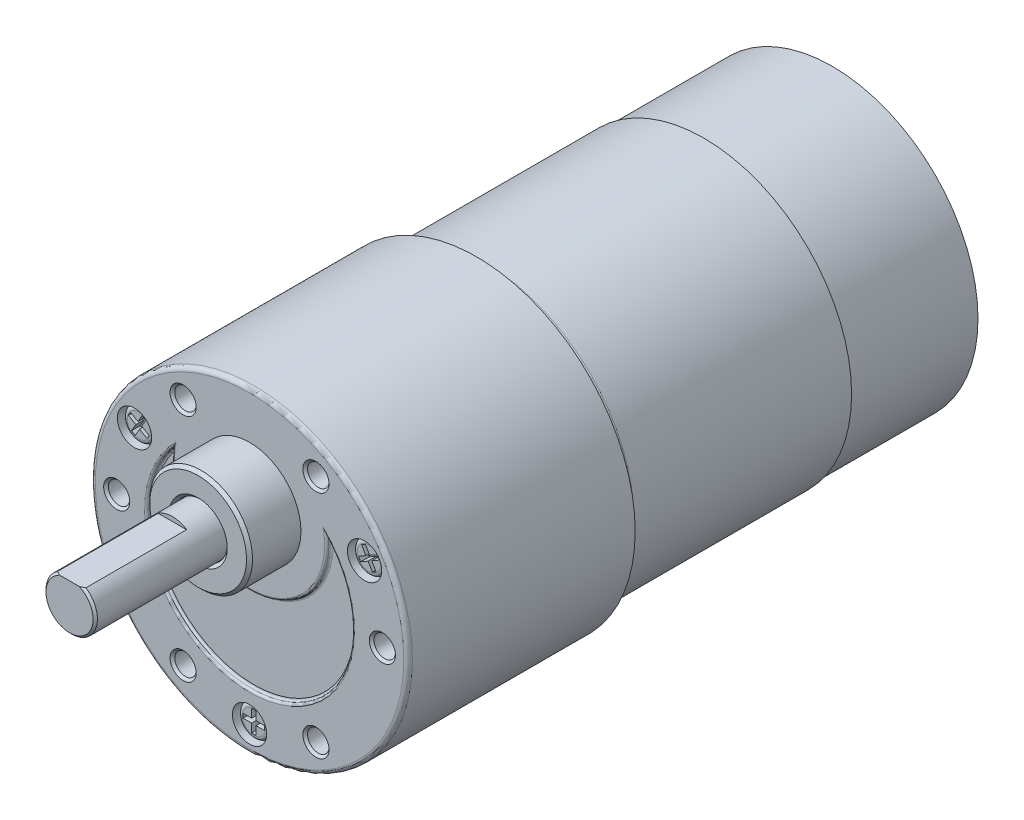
ISO-10303-21;
HEADER;
FILE_DESCRIPTION(('STEP AP214'),'2;1');
FILE_NAME('part.step','',(''),(''),'','','');
FILE_SCHEMA(('AUTOMOTIVE_DESIGN { 1 0 10303 214 1 1 1 1 }'));
ENDSEC;
DATA;
#1=APPLICATION_CONTEXT('core data for automotive mechanical design processes');
#2=APPLICATION_PROTOCOL_DEFINITION('international standard','automotive_design',2000,#1);
#3=PRODUCT_CONTEXT('',#1,'mechanical');
#4=PRODUCT('Part','Part','',(#3));
#5=PRODUCT_RELATED_PRODUCT_CATEGORY('part','',(#4));
#6=PRODUCT_DEFINITION_FORMATION('','',#4);
#7=PRODUCT_DEFINITION_CONTEXT('part definition',#1,'design');
#8=PRODUCT_DEFINITION('design','',#6,#7);
#9=PRODUCT_DEFINITION_SHAPE('','',#8);
#10=(LENGTH_UNIT() NAMED_UNIT(*) SI_UNIT(.MILLI.,.METRE.));
#11=(NAMED_UNIT(*) PLANE_ANGLE_UNIT() SI_UNIT($,.RADIAN.));
#12=(NAMED_UNIT(*) SI_UNIT($,.STERADIAN.) SOLID_ANGLE_UNIT());
#13=UNCERTAINTY_MEASURE_WITH_UNIT(LENGTH_MEASURE(1.E-05),#10,'distance_accuracy_value','');
#14=(GEOMETRIC_REPRESENTATION_CONTEXT(3) GLOBAL_UNCERTAINTY_ASSIGNED_CONTEXT((#13)) GLOBAL_UNIT_ASSIGNED_CONTEXT((#10,
#11,#12)) REPRESENTATION_CONTEXT('',''));
#15=CARTESIAN_POINT('',(0.,0.,0.));
#16=DIRECTION('',(0.,0.,1.));
#17=DIRECTION('',(1.,0.,0.));
#18=AXIS2_PLACEMENT_3D('',#15,#16,#17);
#19=CARTESIAN_POINT('',(0.,0.,-26.6));
#20=DIRECTION('',(0.,0.,-1.));
#21=DIRECTION('',(-1.,0.,0.));
#22=AXIS2_PLACEMENT_3D('',#19,#20,#21);
#23=PLANE('',#22);
#24=CARTESIAN_POINT('',(0.,0.,-26.6));
#25=DIRECTION('',(0.,0.,-1.));
#26=DIRECTION('',(-1.,0.,0.));
#27=AXIS2_PLACEMENT_3D('',#24,#25,#26);
#28=CIRCLE('',#27,15.);
#29=CARTESIAN_POINT('',(-15.,0.,-26.6));
#30=VERTEX_POINT('',#29);
#31=EDGE_CURVE('E438',#30,#30,#28,.T.);
#32=ORIENTED_EDGE('',*,*,#31,.T.);
#33=EDGE_LOOP('',(#32));
#34=FACE_BOUND('',#33,.T.);
#35=CARTESIAN_POINT('',(0.,0.,-26.6));
#36=DIRECTION('',(0.,0.,1.));
#37=DIRECTION('',(-1.,0.,0.));
#38=AXIS2_PLACEMENT_3D('',#35,#36,#37);
#39=CIRCLE('',#38,16.25);
#40=CARTESIAN_POINT('',(-16.25,0.,-26.6));
#41=VERTEX_POINT('',#40);
#42=EDGE_CURVE('E443',#41,#41,#39,.T.);
#43=ORIENTED_EDGE('',*,*,#42,.T.);
#44=EDGE_LOOP('',(#43));
#45=FACE_BOUND('',#44,.T.);
#46=ADVANCED_FACE('F17',(#34,#45),#23,.F.);
#47=CARTESIAN_POINT('',(12.2158620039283,7.341506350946,-1.5));
#48=DIRECTION('',(0.,0.,1.));
#49=DIRECTION('',(1.,0.,0.));
#50=AXIS2_PLACEMENT_3D('',#47,#48,#49);
#51=PLANE('',#50);
#52=DIRECTION('',(-0.866025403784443,-0.499999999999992,0.));
#53=VECTOR('',#52,1.);
#54=CARTESIAN_POINT('',(13.0818874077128,7.84150635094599,-1.5));
#55=LINE('',#54,#53);
#56=CARTESIAN_POINT('',(13.0818874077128,7.84150635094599,-1.5));
#57=VERTEX_POINT('',#56);
#58=CARTESIAN_POINT('',(12.2158620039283,7.341506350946,-1.5));
#59=VERTEX_POINT('',#58);
#60=EDGE_CURVE('E366',#57,#59,#55,.T.);
#61=ORIENTED_EDGE('',*,*,#60,.T.);
#62=DIRECTION('',(0.499999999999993,-0.866025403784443,0.));
#63=VECTOR('',#62,1.);
#64=CARTESIAN_POINT('',(12.2158620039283,7.341506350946,-1.5));
#65=LINE('',#64,#63);
#66=CARTESIAN_POINT('',(12.4658620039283,6.90849364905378,-1.5));
#67=VERTEX_POINT('',#66);
#68=EDGE_CURVE('E11',#59,#67,#65,.T.);
#69=ORIENTED_EDGE('',*,*,#68,.T.);
#70=DIRECTION('',(0.866025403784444,0.499999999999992,0.));
#71=VECTOR('',#70,1.);
#72=CARTESIAN_POINT('',(13.3318874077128,7.40849364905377,-1.5));
#73=LINE('',#72,#71);
#74=CARTESIAN_POINT('',(13.3318874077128,7.40849364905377,-1.5));
#75=VERTEX_POINT('',#74);
#76=EDGE_CURVE('E321',#67,#75,#73,.T.);
#77=ORIENTED_EDGE('',*,*,#76,.T.);
#78=DIRECTION('',(0.499999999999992,-0.866025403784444,0.));
#79=VECTOR('',#78,1.);
#80=CARTESIAN_POINT('',(13.3318874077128,7.40849364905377,-1.5));
#81=LINE('',#80,#79);
#82=CARTESIAN_POINT('',(13.8318874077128,6.54246824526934,-1.5));
#83=VERTEX_POINT('',#82);
#84=EDGE_CURVE('E357',#75,#83,#81,.T.);
#85=ORIENTED_EDGE('',*,*,#84,.T.);
#86=DIRECTION('',(0.866025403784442,0.499999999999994,0.));
#87=VECTOR('',#86,1.);
#88=CARTESIAN_POINT('',(13.8318874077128,6.54246824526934,-1.5));
#89=LINE('',#88,#87);
#90=CARTESIAN_POINT('',(14.264900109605,6.79246824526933,-1.5));
#91=VERTEX_POINT('',#90);
#92=EDGE_CURVE('E386',#83,#91,#89,.T.);
#93=ORIENTED_EDGE('',*,*,#92,.T.);
#94=DIRECTION('',(-0.499999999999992,0.866025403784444,0.));
#95=VECTOR('',#94,1.);
#96=CARTESIAN_POINT('',(13.764900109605,7.65849364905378,-1.5));
#97=LINE('',#96,#95);
#98=CARTESIAN_POINT('',(13.764900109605,7.65849364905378,-1.5));
#99=VERTEX_POINT('',#98);
#100=EDGE_CURVE('E392',#91,#99,#97,.T.);
#101=ORIENTED_EDGE('',*,*,#100,.T.);
#102=DIRECTION('',(0.866025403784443,0.499999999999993,0.));
#103=VECTOR('',#102,1.);
#104=CARTESIAN_POINT('',(13.764900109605,7.65849364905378,-1.5));
#105=LINE('',#104,#103);
#106=CARTESIAN_POINT('',(14.6309255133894,8.15849364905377,-1.5));
#107=VERTEX_POINT('',#106);
#108=EDGE_CURVE('E398',#99,#107,#105,.T.);
#109=ORIENTED_EDGE('',*,*,#108,.T.);
#110=DIRECTION('',(-0.499999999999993,0.866025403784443,0.));
#111=VECTOR('',#110,1.);
#112=CARTESIAN_POINT('',(14.6309255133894,8.15849364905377,-1.5));
#113=LINE('',#112,#111);
#114=CARTESIAN_POINT('',(14.3809255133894,8.59150635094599,-1.5));
#115=VERTEX_POINT('',#114);
#116=EDGE_CURVE('E404',#107,#115,#113,.T.);
#117=ORIENTED_EDGE('',*,*,#116,.T.);
#118=DIRECTION('',(-0.866025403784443,-0.499999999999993,0.));
#119=VECTOR('',#118,1.);
#120=CARTESIAN_POINT('',(13.514900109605,8.091506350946,-1.5));
#121=LINE('',#120,#119);
#122=CARTESIAN_POINT('',(13.514900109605,8.091506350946,-1.5));
#123=VERTEX_POINT('',#122);
#124=EDGE_CURVE('E410',#115,#123,#121,.T.);
#125=ORIENTED_EDGE('',*,*,#124,.T.);
#126=DIRECTION('',(-0.499999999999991,0.866025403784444,0.));
#127=VECTOR('',#126,1.);
#128=CARTESIAN_POINT('',(13.514900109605,8.091506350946,-1.5));
#129=LINE('',#128,#127);
#130=CARTESIAN_POINT('',(13.014900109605,8.95753175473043,-1.5));
#131=VERTEX_POINT('',#130);
#132=EDGE_CURVE('E416',#123,#131,#129,.T.);
#133=ORIENTED_EDGE('',*,*,#132,.T.);
#134=DIRECTION('',(-0.866025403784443,-0.499999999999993,0.));
#135=VECTOR('',#134,1.);
#136=CARTESIAN_POINT('',(13.014900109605,8.95753175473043,-1.5));
#137=LINE('',#136,#135);
#138=CARTESIAN_POINT('',(12.5818874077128,8.70753175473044,-1.5));
#139=VERTEX_POINT('',#138);
#140=EDGE_CURVE('E422',#131,#139,#137,.T.);
#141=ORIENTED_EDGE('',*,*,#140,.T.);
#142=DIRECTION('',(0.499999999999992,-0.866025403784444,0.));
#143=VECTOR('',#142,1.);
#144=CARTESIAN_POINT('',(13.0818874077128,7.84150635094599,-1.5));
#145=LINE('',#144,#143);
#146=EDGE_CURVE('E428',#139,#57,#145,.T.);
#147=ORIENTED_EDGE('',*,*,#146,.T.);
#148=EDGE_LOOP('',(#61,#69,#77,#85,#93,#101,#109,#117,#125,#133,#141,#147));
#149=FACE_BOUND('',#148,.T.);
#150=ADVANCED_FACE('F728',(#149),#51,.T.);
#151=CARTESIAN_POINT('',(12.2158620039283,7.341506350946,-1.5));
#152=DIRECTION('',(-0.866025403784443,-0.499999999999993,0.));
#153=DIRECTION('',(0.499999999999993,-0.866025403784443,0.));
#154=AXIS2_PLACEMENT_3D('',#151,#152,#153);
#155=PLANE('',#154);
#156=DIRECTION('',(0.499999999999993,-0.866025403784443,0.));
#157=VECTOR('',#156,1.);
#158=CARTESIAN_POINT('',(12.2158620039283,7.341506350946,-0.5));
#159=LINE('',#158,#157);
#160=CARTESIAN_POINT('',(12.2158620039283,7.341506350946,-0.5));
#161=VERTEX_POINT('',#160);
#162=CARTESIAN_POINT('',(12.4658620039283,6.90849364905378,-0.5));
#163=VERTEX_POINT('',#162);
#164=EDGE_CURVE('E326',#161,#163,#159,.T.);
#165=ORIENTED_EDGE('',*,*,#164,.T.);
#166=DIRECTION('',(0.,0.,1.));
#167=VECTOR('',#166,1.);
#168=CARTESIAN_POINT('',(12.4658620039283,6.90849364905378,-1.5));
#169=LINE('',#168,#167);
#170=EDGE_CURVE('E34',#67,#163,#169,.T.);
#171=ORIENTED_EDGE('',*,*,#170,.F.);
#172=ORIENTED_EDGE('',*,*,#68,.F.);
#173=DIRECTION('',(0.,0.,1.));
#174=VECTOR('',#173,1.);
#175=CARTESIAN_POINT('',(12.2158620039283,7.341506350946,-1.5));
#176=LINE('',#175,#174);
#177=EDGE_CURVE('E329',#59,#161,#176,.T.);
#178=ORIENTED_EDGE('',*,*,#177,.T.);
#179=EDGE_LOOP('',(#165,#171,#172,#178));
#180=FACE_BOUND('',#179,.T.);
#181=ADVANCED_FACE('F327',(#180),#155,.F.);
#182=CARTESIAN_POINT('',(13.3318874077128,7.40849364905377,-1.5));
#183=DIRECTION('',(0.499999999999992,-0.866025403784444,0.));
#184=DIRECTION('',(0.866025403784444,0.499999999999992,0.));
#185=AXIS2_PLACEMENT_3D('',#182,#183,#184);
#186=PLANE('',#185);
#187=DIRECTION('',(0.866025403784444,0.499999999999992,0.));
#188=VECTOR('',#187,1.);
#189=CARTESIAN_POINT('',(13.3318874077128,7.40849364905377,-0.5));
#190=LINE('',#189,#188);
#191=CARTESIAN_POINT('',(13.3318874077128,7.40849364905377,-0.5));
#192=VERTEX_POINT('',#191);
#193=EDGE_CURVE('E319',#163,#192,#190,.T.);
#194=ORIENTED_EDGE('',*,*,#193,.T.);
#195=DIRECTION('',(0.,0.,1.));
#196=VECTOR('',#195,1.);
#197=CARTESIAN_POINT('',(13.3318874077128,7.40849364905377,-1.5));
#198=LINE('',#197,#196);
#199=EDGE_CURVE('E355',#75,#192,#198,.T.);
#200=ORIENTED_EDGE('',*,*,#199,.F.);
#201=ORIENTED_EDGE('',*,*,#76,.F.);
#202=ORIENTED_EDGE('',*,*,#170,.T.);
#203=EDGE_LOOP('',(#194,#200,#201,#202));
#204=FACE_BOUND('',#203,.T.);
#205=ADVANCED_FACE('F316',(#204),#186,.F.);
#206=CARTESIAN_POINT('',(13.3318874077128,7.40849364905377,-1.5));
#207=DIRECTION('',(-0.866025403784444,-0.499999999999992,0.));
#208=DIRECTION('',(0.499999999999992,-0.866025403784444,0.));
#209=AXIS2_PLACEMENT_3D('',#206,#207,#208);
#210=PLANE('',#209);
#211=DIRECTION('',(0.499999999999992,-0.866025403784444,0.));
#212=VECTOR('',#211,1.);
#213=CARTESIAN_POINT('',(13.3318874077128,7.40849364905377,-0.5));
#214=LINE('',#213,#212);
#215=CARTESIAN_POINT('',(13.8318874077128,6.54246824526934,-0.5));
#216=VERTEX_POINT('',#215);
#217=EDGE_CURVE('E339',#192,#216,#214,.T.);
#218=ORIENTED_EDGE('',*,*,#217,.T.);
#219=DIRECTION('',(0.,0.,1.));
#220=VECTOR('',#219,1.);
#221=CARTESIAN_POINT('',(13.8318874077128,6.54246824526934,-1.5));
#222=LINE('',#221,#220);
#223=EDGE_CURVE('E383',#83,#216,#222,.T.);
#224=ORIENTED_EDGE('',*,*,#223,.F.);
#225=ORIENTED_EDGE('',*,*,#84,.F.);
#226=ORIENTED_EDGE('',*,*,#199,.T.);
#227=EDGE_LOOP('',(#218,#224,#225,#226));
#228=FACE_BOUND('',#227,.T.);
#229=ADVANCED_FACE('F719',(#228),#210,.F.);
#230=CARTESIAN_POINT('',(13.8318874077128,6.54246824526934,-1.5));
#231=DIRECTION('',(0.499999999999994,-0.866025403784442,0.));
#232=DIRECTION('',(0.866025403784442,0.499999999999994,0.));
#233=AXIS2_PLACEMENT_3D('',#230,#231,#232);
#234=PLANE('',#233);
#235=DIRECTION('',(0.866025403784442,0.499999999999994,0.));
#236=VECTOR('',#235,1.);
#237=CARTESIAN_POINT('',(13.8318874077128,6.54246824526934,-0.5));
#238=LINE('',#237,#236);
#239=CARTESIAN_POINT('',(14.264900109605,6.79246824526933,-0.5));
#240=VERTEX_POINT('',#239);
#241=EDGE_CURVE('E347',#216,#240,#238,.T.);
#242=ORIENTED_EDGE('',*,*,#241,.T.);
#243=DIRECTION('',(0.,0.,1.));
#244=VECTOR('',#243,1.);
#245=CARTESIAN_POINT('',(14.264900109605,6.79246824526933,-1.5));
#246=LINE('',#245,#244);
#247=EDGE_CURVE('E389',#91,#240,#246,.T.);
#248=ORIENTED_EDGE('',*,*,#247,.F.);
#249=ORIENTED_EDGE('',*,*,#92,.F.);
#250=ORIENTED_EDGE('',*,*,#223,.T.);
#251=EDGE_LOOP('',(#242,#248,#249,#250));
#252=FACE_BOUND('',#251,.T.);
#253=ADVANCED_FACE('F715',(#252),#234,.F.);
#254=CARTESIAN_POINT('',(13.764900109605,7.65849364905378,-1.5));
#255=DIRECTION('',(0.866025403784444,0.499999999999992,0.));
#256=DIRECTION('',(-0.499999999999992,0.866025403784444,0.));
#257=AXIS2_PLACEMENT_3D('',#254,#255,#256);
#258=PLANE('',#257);
#259=DIRECTION('',(-0.499999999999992,0.866025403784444,0.));
#260=VECTOR('',#259,1.);
#261=CARTESIAN_POINT('',(13.764900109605,7.65849364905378,-0.5));
#262=LINE('',#261,#260);
#263=CARTESIAN_POINT('',(13.764900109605,7.65849364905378,-0.5));
#264=VERTEX_POINT('',#263);
#265=EDGE_CURVE('E1545',#240,#264,#262,.T.);
#266=ORIENTED_EDGE('',*,*,#265,.T.);
#267=DIRECTION('',(0.,0.,1.));
#268=VECTOR('',#267,1.);
#269=CARTESIAN_POINT('',(13.764900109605,7.65849364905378,-1.5));
#270=LINE('',#269,#268);
#271=EDGE_CURVE('E395',#99,#264,#270,.T.);
#272=ORIENTED_EDGE('',*,*,#271,.F.);
#273=ORIENTED_EDGE('',*,*,#100,.F.);
#274=ORIENTED_EDGE('',*,*,#247,.T.);
#275=EDGE_LOOP('',(#266,#272,#273,#274));
#276=FACE_BOUND('',#275,.T.);
#277=ADVANCED_FACE('F711',(#276),#258,.F.);
#278=CARTESIAN_POINT('',(13.764900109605,7.65849364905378,-1.5));
#279=DIRECTION('',(0.499999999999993,-0.866025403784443,0.));
#280=DIRECTION('',(0.866025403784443,0.499999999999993,0.));
#281=AXIS2_PLACEMENT_3D('',#278,#279,#280);
#282=PLANE('',#281);
#283=DIRECTION('',(0.866025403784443,0.499999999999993,0.));
#284=VECTOR('',#283,1.);
#285=CARTESIAN_POINT('',(13.764900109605,7.65849364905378,-0.5));
#286=LINE('',#285,#284);
#287=CARTESIAN_POINT('',(14.6309255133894,8.15849364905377,-0.5));
#288=VERTEX_POINT('',#287);
#289=EDGE_CURVE('E1535',#264,#288,#286,.T.);
#290=ORIENTED_EDGE('',*,*,#289,.T.);
#291=DIRECTION('',(0.,0.,1.));
#292=VECTOR('',#291,1.);
#293=CARTESIAN_POINT('',(14.6309255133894,8.15849364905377,-1.5));
#294=LINE('',#293,#292);
#295=EDGE_CURVE('E401',#107,#288,#294,.T.);
#296=ORIENTED_EDGE('',*,*,#295,.F.);
#297=ORIENTED_EDGE('',*,*,#108,.F.);
#298=ORIENTED_EDGE('',*,*,#271,.T.);
#299=EDGE_LOOP('',(#290,#296,#297,#298));
#300=FACE_BOUND('',#299,.T.);
#301=ADVANCED_FACE('F707',(#300),#282,.F.);
#302=CARTESIAN_POINT('',(14.6309255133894,8.15849364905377,-1.5));
#303=DIRECTION('',(0.866025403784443,0.499999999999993,0.));
#304=DIRECTION('',(-0.499999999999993,0.866025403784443,0.));
#305=AXIS2_PLACEMENT_3D('',#302,#303,#304);
#306=PLANE('',#305);
#307=DIRECTION('',(-0.499999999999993,0.866025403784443,0.));
#308=VECTOR('',#307,1.);
#309=CARTESIAN_POINT('',(14.6309255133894,8.15849364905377,-0.5));
#310=LINE('',#309,#308);
#311=CARTESIAN_POINT('',(14.3809255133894,8.59150635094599,-0.5));
#312=VERTEX_POINT('',#311);
#313=EDGE_CURVE('E1525',#288,#312,#310,.T.);
#314=ORIENTED_EDGE('',*,*,#313,.T.);
#315=DIRECTION('',(0.,0.,1.));
#316=VECTOR('',#315,1.);
#317=CARTESIAN_POINT('',(14.3809255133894,8.59150635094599,-1.5));
#318=LINE('',#317,#316);
#319=EDGE_CURVE('E407',#115,#312,#318,.T.);
#320=ORIENTED_EDGE('',*,*,#319,.F.);
#321=ORIENTED_EDGE('',*,*,#116,.F.);
#322=ORIENTED_EDGE('',*,*,#295,.T.);
#323=EDGE_LOOP('',(#314,#320,#321,#322));
#324=FACE_BOUND('',#323,.T.);
#325=ADVANCED_FACE('F703',(#324),#306,.F.);
#326=CARTESIAN_POINT('',(13.514900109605,8.091506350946,-1.5));
#327=DIRECTION('',(-0.499999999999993,0.866025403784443,0.));
#328=DIRECTION('',(-0.866025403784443,-0.499999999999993,0.));
#329=AXIS2_PLACEMENT_3D('',#326,#327,#328);
#330=PLANE('',#329);
#331=DIRECTION('',(-0.866025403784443,-0.499999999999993,0.));
#332=VECTOR('',#331,1.);
#333=CARTESIAN_POINT('',(13.514900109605,8.091506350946,-0.5));
#334=LINE('',#333,#332);
#335=CARTESIAN_POINT('',(13.514900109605,8.091506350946,-0.5));
#336=VERTEX_POINT('',#335);
#337=EDGE_CURVE('E1515',#312,#336,#334,.T.);
#338=ORIENTED_EDGE('',*,*,#337,.T.);
#339=DIRECTION('',(0.,0.,1.));
#340=VECTOR('',#339,1.);
#341=CARTESIAN_POINT('',(13.514900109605,8.091506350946,-1.5));
#342=LINE('',#341,#340);
#343=EDGE_CURVE('E413',#123,#336,#342,.T.);
#344=ORIENTED_EDGE('',*,*,#343,.F.);
#345=ORIENTED_EDGE('',*,*,#124,.F.);
#346=ORIENTED_EDGE('',*,*,#319,.T.);
#347=EDGE_LOOP('',(#338,#344,#345,#346));
#348=FACE_BOUND('',#347,.T.);
#349=ADVANCED_FACE('F699',(#348),#330,.F.);
#350=CARTESIAN_POINT('',(13.514900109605,8.091506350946,-1.5));
#351=DIRECTION('',(0.866025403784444,0.499999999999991,0.));
#352=DIRECTION('',(-0.499999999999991,0.866025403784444,0.));
#353=AXIS2_PLACEMENT_3D('',#350,#351,#352);
#354=PLANE('',#353);
#355=DIRECTION('',(-0.499999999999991,0.866025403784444,0.));
#356=VECTOR('',#355,1.);
#357=CARTESIAN_POINT('',(13.514900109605,8.091506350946,-0.5));
#358=LINE('',#357,#356);
#359=CARTESIAN_POINT('',(13.014900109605,8.95753175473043,-0.5));
#360=VERTEX_POINT('',#359);
#361=EDGE_CURVE('E1505',#336,#360,#358,.T.);
#362=ORIENTED_EDGE('',*,*,#361,.T.);
#363=DIRECTION('',(0.,0.,1.));
#364=VECTOR('',#363,1.);
#365=CARTESIAN_POINT('',(13.014900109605,8.95753175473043,-1.5));
#366=LINE('',#365,#364);
#367=EDGE_CURVE('E419',#131,#360,#366,.T.);
#368=ORIENTED_EDGE('',*,*,#367,.F.);
#369=ORIENTED_EDGE('',*,*,#132,.F.);
#370=ORIENTED_EDGE('',*,*,#343,.T.);
#371=EDGE_LOOP('',(#362,#368,#369,#370));
#372=FACE_BOUND('',#371,.T.);
#373=ADVANCED_FACE('F695',(#372),#354,.F.);
#374=CARTESIAN_POINT('',(13.014900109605,8.95753175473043,-1.5));
#375=DIRECTION('',(-0.499999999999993,0.866025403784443,0.));
#376=DIRECTION('',(-0.866025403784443,-0.499999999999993,0.));
#377=AXIS2_PLACEMENT_3D('',#374,#375,#376);
#378=PLANE('',#377);
#379=DIRECTION('',(-0.866025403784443,-0.499999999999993,0.));
#380=VECTOR('',#379,1.);
#381=CARTESIAN_POINT('',(13.014900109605,8.95753175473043,-0.5));
#382=LINE('',#381,#380);
#383=CARTESIAN_POINT('',(12.5818874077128,8.70753175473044,-0.5));
#384=VERTEX_POINT('',#383);
#385=EDGE_CURVE('E1495',#360,#384,#382,.T.);
#386=ORIENTED_EDGE('',*,*,#385,.T.);
#387=DIRECTION('',(0.,0.,1.));
#388=VECTOR('',#387,1.);
#389=CARTESIAN_POINT('',(12.5818874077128,8.70753175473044,-1.5));
#390=LINE('',#389,#388);
#391=EDGE_CURVE('E425',#139,#384,#390,.T.);
#392=ORIENTED_EDGE('',*,*,#391,.F.);
#393=ORIENTED_EDGE('',*,*,#140,.F.);
#394=ORIENTED_EDGE('',*,*,#367,.T.);
#395=EDGE_LOOP('',(#386,#392,#393,#394));
#396=FACE_BOUND('',#395,.T.);
#397=ADVANCED_FACE('F691',(#396),#378,.F.);
#398=CARTESIAN_POINT('',(13.0818874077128,7.84150635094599,-1.5));
#399=DIRECTION('',(-0.866025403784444,-0.499999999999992,0.));
#400=DIRECTION('',(0.499999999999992,-0.866025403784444,0.));
#401=AXIS2_PLACEMENT_3D('',#398,#399,#400);
#402=PLANE('',#401);
#403=DIRECTION('',(0.499999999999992,-0.866025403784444,0.));
#404=VECTOR('',#403,1.);
#405=CARTESIAN_POINT('',(13.0818874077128,7.84150635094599,-0.5));
#406=LINE('',#405,#404);
#407=CARTESIAN_POINT('',(13.0818874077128,7.84150635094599,-0.5));
#408=VERTEX_POINT('',#407);
#409=EDGE_CURVE('E1489',#384,#408,#406,.T.);
#410=ORIENTED_EDGE('',*,*,#409,.T.);
#411=DIRECTION('',(0.,0.,1.));
#412=VECTOR('',#411,1.);
#413=CARTESIAN_POINT('',(13.0818874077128,7.84150635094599,-1.5));
#414=LINE('',#413,#412);
#415=EDGE_CURVE('E372',#57,#408,#414,.T.);
#416=ORIENTED_EDGE('',*,*,#415,.F.);
#417=ORIENTED_EDGE('',*,*,#146,.F.);
#418=ORIENTED_EDGE('',*,*,#391,.T.);
#419=EDGE_LOOP('',(#410,#416,#417,#418));
#420=FACE_BOUND('',#419,.T.);
#421=ADVANCED_FACE('F687',(#420),#402,.F.);
#422=CARTESIAN_POINT('',(13.0818874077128,7.84150635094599,-1.5));
#423=DIRECTION('',(-0.499999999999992,0.866025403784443,0.));
#424=DIRECTION('',(-0.866025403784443,-0.499999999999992,0.));
#425=AXIS2_PLACEMENT_3D('',#422,#423,#424);
#426=PLANE('',#425);
#427=DIRECTION('',(-0.866025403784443,-0.499999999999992,0.));
#428=VECTOR('',#427,1.);
#429=CARTESIAN_POINT('',(13.0818874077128,7.84150635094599,-0.5));
#430=LINE('',#429,#428);
#431=EDGE_CURVE('E1426',#408,#161,#430,.T.);
#432=ORIENTED_EDGE('',*,*,#431,.T.);
#433=ORIENTED_EDGE('',*,*,#177,.F.);
#434=ORIENTED_EDGE('',*,*,#60,.F.);
#435=ORIENTED_EDGE('',*,*,#415,.T.);
#436=EDGE_LOOP('',(#432,#433,#434,#435));
#437=FACE_BOUND('',#436,.T.);
#438=ADVANCED_FACE('F683',(#437),#426,.F.);
#439=CARTESIAN_POINT('',(-12.4658620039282,6.90849364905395,-1.5));
#440=DIRECTION('',(0.,0.,1.));
#441=DIRECTION('',(1.,0.,0.));
#442=AXIS2_PLACEMENT_3D('',#439,#440,#441);
#443=PLANE('',#442);
#444=DIRECTION('',(0.866025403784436,-0.5,0.));
#445=VECTOR('',#444,1.);
#446=CARTESIAN_POINT('',(-13.3318874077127,7.40849364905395,-1.5));
#447=LINE('',#446,#445);
#448=CARTESIAN_POINT('',(-13.3318874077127,7.40849364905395,-1.5));
#449=VERTEX_POINT('',#448);
#450=CARTESIAN_POINT('',(-12.4658620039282,6.90849364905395,-1.5));
#451=VERTEX_POINT('',#450);
#452=EDGE_CURVE('E1312',#449,#451,#447,.T.);
#453=ORIENTED_EDGE('',*,*,#452,.T.);
#454=DIRECTION('',(0.500000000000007,0.866025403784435,0.));
#455=VECTOR('',#454,1.);
#456=CARTESIAN_POINT('',(-12.4658620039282,6.90849364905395,-1.5));
#457=LINE('',#456,#455);
#458=CARTESIAN_POINT('',(-12.2158620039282,7.34150635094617,-1.5));
#459=VERTEX_POINT('',#458);
#460=EDGE_CURVE('E367',#451,#459,#457,.T.);
#461=ORIENTED_EDGE('',*,*,#460,.T.);
#462=DIRECTION('',(-0.866025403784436,0.5,0.));
#463=VECTOR('',#462,1.);
#464=CARTESIAN_POINT('',(-13.0818874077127,7.84150635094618,-1.5));
#465=LINE('',#464,#463);
#466=CARTESIAN_POINT('',(-13.0818874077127,7.84150635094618,-1.5));
#467=VERTEX_POINT('',#466);
#468=EDGE_CURVE('E1420',#459,#467,#465,.T.);
#469=ORIENTED_EDGE('',*,*,#468,.T.);
#470=DIRECTION('',(0.5,0.866025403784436,0.));
#471=VECTOR('',#470,1.);
#472=CARTESIAN_POINT('',(-13.0818874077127,7.84150635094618,-1.5));
#473=LINE('',#472,#471);
#474=CARTESIAN_POINT('',(-12.5818874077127,8.7075317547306,-1.5));
#475=VERTEX_POINT('',#474);
#476=EDGE_CURVE('E1408',#467,#475,#473,.T.);
#477=ORIENTED_EDGE('',*,*,#476,.T.);
#478=DIRECTION('',(-0.866025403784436,0.5,0.));
#479=VECTOR('',#478,1.);
#480=CARTESIAN_POINT('',(-12.5818874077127,8.7075317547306,-1.5));
#481=LINE('',#480,#479);
#482=CARTESIAN_POINT('',(-13.0149001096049,8.95753175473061,-1.5));
#483=VERTEX_POINT('',#482);
#484=EDGE_CURVE('E1396',#475,#483,#481,.T.);
#485=ORIENTED_EDGE('',*,*,#484,.T.);
#486=DIRECTION('',(-0.5,-0.866025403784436,0.));
#487=VECTOR('',#486,1.);
#488=CARTESIAN_POINT('',(-13.5149001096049,8.09150635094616,-1.5));
#489=LINE('',#488,#487);
#490=CARTESIAN_POINT('',(-13.5149001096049,8.09150635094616,-1.5));
#491=VERTEX_POINT('',#490);
#492=EDGE_CURVE('E1384',#483,#491,#489,.T.);
#493=ORIENTED_EDGE('',*,*,#492,.T.);
#494=DIRECTION('',(-0.866025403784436,0.5,0.));
#495=VECTOR('',#494,1.);
#496=CARTESIAN_POINT('',(-13.5149001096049,8.09150635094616,-1.5));
#497=LINE('',#496,#495);
#498=CARTESIAN_POINT('',(-14.3809255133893,8.59150635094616,-1.5));
#499=VERTEX_POINT('',#498);
#500=EDGE_CURVE('E1372',#491,#499,#497,.T.);
#501=ORIENTED_EDGE('',*,*,#500,.T.);
#502=DIRECTION('',(-0.5,-0.866025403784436,0.));
#503=VECTOR('',#502,1.);
#504=CARTESIAN_POINT('',(-14.3809255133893,8.59150635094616,-1.5));
#505=LINE('',#504,#503);
#506=CARTESIAN_POINT('',(-14.6309255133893,8.15849364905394,-1.5));
#507=VERTEX_POINT('',#506);
#508=EDGE_CURVE('E1360',#499,#507,#505,.T.);
#509=ORIENTED_EDGE('',*,*,#508,.T.);
#510=DIRECTION('',(0.866025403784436,-0.5,0.));
#511=VECTOR('',#510,1.);
#512=CARTESIAN_POINT('',(-13.7649001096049,7.65849364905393,-1.5));
#513=LINE('',#512,#511);
#514=CARTESIAN_POINT('',(-13.7649001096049,7.65849364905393,-1.5));
#515=VERTEX_POINT('',#514);
#516=EDGE_CURVE('E1348',#507,#515,#513,.T.);
#517=ORIENTED_EDGE('',*,*,#516,.T.);
#518=DIRECTION('',(-0.5,-0.866025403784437,0.));
#519=VECTOR('',#518,1.);
#520=CARTESIAN_POINT('',(-13.7649001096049,7.65849364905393,-1.5));
#521=LINE('',#520,#519);
#522=CARTESIAN_POINT('',(-14.2649001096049,6.79246824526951,-1.5));
#523=VERTEX_POINT('',#522);
#524=EDGE_CURVE('E1336',#515,#523,#521,.T.);
#525=ORIENTED_EDGE('',*,*,#524,.T.);
#526=DIRECTION('',(0.866025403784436,-0.5,0.));
#527=VECTOR('',#526,1.);
#528=CARTESIAN_POINT('',(-14.2649001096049,6.79246824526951,-1.5));
#529=LINE('',#528,#527);
#530=CARTESIAN_POINT('',(-13.8318874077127,6.54246824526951,-1.5));
#531=VERTEX_POINT('',#530);
#532=EDGE_CURVE('E1324',#523,#531,#529,.T.);
#533=ORIENTED_EDGE('',*,*,#532,.T.);
#534=DIRECTION('',(0.5,0.866025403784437,0.));
#535=VECTOR('',#534,1.);
#536=CARTESIAN_POINT('',(-13.3318874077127,7.40849364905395,-1.5));
#537=LINE('',#536,#535);
#538=EDGE_CURVE('E1311',#531,#449,#537,.T.);
#539=ORIENTED_EDGE('',*,*,#538,.T.);
#540=EDGE_LOOP('',(#453,#461,#469,#477,#485,#493,#501,#509,#517,#525,#533,#539));
#541=FACE_BOUND('',#540,.T.);
#542=ADVANCED_FACE('F679',(#541),#443,.T.);
#543=CARTESIAN_POINT('',(-12.4658620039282,6.90849364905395,-1.5));
#544=DIRECTION('',(0.866025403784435,-0.500000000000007,0.));
#545=DIRECTION('',(0.500000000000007,0.866025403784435,0.));
#546=AXIS2_PLACEMENT_3D('',#543,#544,#545);
#547=PLANE('',#546);
#548=DIRECTION('',(0.500000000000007,0.866025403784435,0.));
#549=VECTOR('',#548,1.);
#550=CARTESIAN_POINT('',(-12.4658620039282,6.90849364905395,-0.5));
#551=LINE('',#550,#549);
#552=CARTESIAN_POINT('',(-12.4658620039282,6.90849364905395,-0.5));
#553=VERTEX_POINT('',#552);
#554=CARTESIAN_POINT('',(-12.2158620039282,7.34150635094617,-0.5));
#555=VERTEX_POINT('',#554);
#556=EDGE_CURVE('E1414',#553,#555,#551,.T.);
#557=ORIENTED_EDGE('',*,*,#556,.T.);
#558=DIRECTION('',(0.,0.,1.));
#559=VECTOR('',#558,1.);
#560=CARTESIAN_POINT('',(-12.2158620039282,7.34150635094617,-1.5));
#561=LINE('',#560,#559);
#562=EDGE_CURVE('E1429',#459,#555,#561,.T.);
#563=ORIENTED_EDGE('',*,*,#562,.F.);
#564=ORIENTED_EDGE('',*,*,#460,.F.);
#565=DIRECTION('',(0.,0.,1.));
#566=VECTOR('',#565,1.);
#567=CARTESIAN_POINT('',(-12.4658620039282,6.90849364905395,-1.5));
#568=LINE('',#567,#566);
#569=EDGE_CURVE('E1253',#451,#553,#568,.T.);
#570=ORIENTED_EDGE('',*,*,#569,.T.);
#571=EDGE_LOOP('',(#557,#563,#564,#570));
#572=FACE_BOUND('',#571,.T.);
#573=ADVANCED_FACE('F675',(#572),#547,.F.);
#574=CARTESIAN_POINT('',(-13.0818874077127,7.84150635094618,-1.5));
#575=DIRECTION('',(0.5,0.866025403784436,0.));
#576=DIRECTION('',(-0.866025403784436,0.5,0.));
#577=AXIS2_PLACEMENT_3D('',#574,#575,#576);
#578=PLANE('',#577);
#579=DIRECTION('',(-0.866025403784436,0.5,0.));
#580=VECTOR('',#579,1.);
#581=CARTESIAN_POINT('',(-13.0818874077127,7.84150635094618,-0.5));
#582=LINE('',#581,#580);
#583=CARTESIAN_POINT('',(-13.0818874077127,7.84150635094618,-0.5));
#584=VERTEX_POINT('',#583);
#585=EDGE_CURVE('E1402',#555,#584,#582,.T.);
#586=ORIENTED_EDGE('',*,*,#585,.T.);
#587=DIRECTION('',(0.,0.,1.));
#588=VECTOR('',#587,1.);
#589=CARTESIAN_POINT('',(-13.0818874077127,7.84150635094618,-1.5));
#590=LINE('',#589,#588);
#591=EDGE_CURVE('E1417',#467,#584,#590,.T.);
#592=ORIENTED_EDGE('',*,*,#591,.F.);
#593=ORIENTED_EDGE('',*,*,#468,.F.);
#594=ORIENTED_EDGE('',*,*,#562,.T.);
#595=EDGE_LOOP('',(#586,#592,#593,#594));
#596=FACE_BOUND('',#595,.T.);
#597=ADVANCED_FACE('F671',(#596),#578,.F.);
#598=CARTESIAN_POINT('',(-13.0818874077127,7.84150635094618,-1.5));
#599=DIRECTION('',(0.866025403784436,-0.5,0.));
#600=DIRECTION('',(0.5,0.866025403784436,0.));
#601=AXIS2_PLACEMENT_3D('',#598,#599,#600);
#602=PLANE('',#601);
#603=DIRECTION('',(0.5,0.866025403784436,0.));
#604=VECTOR('',#603,1.);
#605=CARTESIAN_POINT('',(-13.0818874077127,7.84150635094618,-0.5));
#606=LINE('',#605,#604);
#607=CARTESIAN_POINT('',(-12.5818874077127,8.7075317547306,-0.5));
#608=VERTEX_POINT('',#607);
#609=EDGE_CURVE('E1390',#584,#608,#606,.T.);
#610=ORIENTED_EDGE('',*,*,#609,.T.);
#611=DIRECTION('',(0.,0.,1.));
#612=VECTOR('',#611,1.);
#613=CARTESIAN_POINT('',(-12.5818874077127,8.7075317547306,-1.5));
#614=LINE('',#613,#612);
#615=EDGE_CURVE('E1405',#475,#608,#614,.T.);
#616=ORIENTED_EDGE('',*,*,#615,.F.);
#617=ORIENTED_EDGE('',*,*,#476,.F.);
#618=ORIENTED_EDGE('',*,*,#591,.T.);
#619=EDGE_LOOP('',(#610,#616,#617,#618));
#620=FACE_BOUND('',#619,.T.);
#621=ADVANCED_FACE('F667',(#620),#602,.F.);
#622=CARTESIAN_POINT('',(-12.5818874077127,8.7075317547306,-1.5));
#623=DIRECTION('',(0.5,0.866025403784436,0.));
#624=DIRECTION('',(-0.866025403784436,0.5,0.));
#625=AXIS2_PLACEMENT_3D('',#622,#623,#624);
#626=PLANE('',#625);
#627=DIRECTION('',(-0.866025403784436,0.5,0.));
#628=VECTOR('',#627,1.);
#629=CARTESIAN_POINT('',(-12.5818874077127,8.7075317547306,-0.5));
#630=LINE('',#629,#628);
#631=CARTESIAN_POINT('',(-13.0149001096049,8.95753175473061,-0.5));
#632=VERTEX_POINT('',#631);
#633=EDGE_CURVE('E1378',#608,#632,#630,.T.);
#634=ORIENTED_EDGE('',*,*,#633,.T.);
#635=DIRECTION('',(0.,0.,1.));
#636=VECTOR('',#635,1.);
#637=CARTESIAN_POINT('',(-13.0149001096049,8.95753175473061,-1.5));
#638=LINE('',#637,#636);
#639=EDGE_CURVE('E1393',#483,#632,#638,.T.);
#640=ORIENTED_EDGE('',*,*,#639,.F.);
#641=ORIENTED_EDGE('',*,*,#484,.F.);
#642=ORIENTED_EDGE('',*,*,#615,.T.);
#643=EDGE_LOOP('',(#634,#640,#641,#642));
#644=FACE_BOUND('',#643,.T.);
#645=ADVANCED_FACE('F663',(#644),#626,.F.);
#646=CARTESIAN_POINT('',(-13.5149001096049,8.09150635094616,-1.5));
#647=DIRECTION('',(-0.866025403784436,0.5,0.));
#648=DIRECTION('',(-0.5,-0.866025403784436,0.));
#649=AXIS2_PLACEMENT_3D('',#646,#647,#648);
#650=PLANE('',#649);
#651=DIRECTION('',(-0.5,-0.866025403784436,0.));
#652=VECTOR('',#651,1.);
#653=CARTESIAN_POINT('',(-13.5149001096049,8.09150635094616,-0.5));
#654=LINE('',#653,#652);
#655=CARTESIAN_POINT('',(-13.5149001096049,8.09150635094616,-0.5));
#656=VERTEX_POINT('',#655);
#657=EDGE_CURVE('E1366',#632,#656,#654,.T.);
#658=ORIENTED_EDGE('',*,*,#657,.T.);
#659=DIRECTION('',(0.,0.,1.));
#660=VECTOR('',#659,1.);
#661=CARTESIAN_POINT('',(-13.5149001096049,8.09150635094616,-1.5));
#662=LINE('',#661,#660);
#663=EDGE_CURVE('E1381',#491,#656,#662,.T.);
#664=ORIENTED_EDGE('',*,*,#663,.F.);
#665=ORIENTED_EDGE('',*,*,#492,.F.);
#666=ORIENTED_EDGE('',*,*,#639,.T.);
#667=EDGE_LOOP('',(#658,#664,#665,#666));
#668=FACE_BOUND('',#667,.T.);
#669=ADVANCED_FACE('F659',(#668),#650,.F.);
#670=CARTESIAN_POINT('',(-13.5149001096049,8.09150635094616,-1.5));
#671=DIRECTION('',(0.5,0.866025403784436,0.));
#672=DIRECTION('',(-0.866025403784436,0.5,0.));
#673=AXIS2_PLACEMENT_3D('',#670,#671,#672);
#674=PLANE('',#673);
#675=DIRECTION('',(-0.866025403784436,0.5,0.));
#676=VECTOR('',#675,1.);
#677=CARTESIAN_POINT('',(-13.5149001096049,8.09150635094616,-0.5));
#678=LINE('',#677,#676);
#679=CARTESIAN_POINT('',(-14.3809255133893,8.59150635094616,-0.5));
#680=VERTEX_POINT('',#679);
#681=EDGE_CURVE('E1354',#656,#680,#678,.T.);
#682=ORIENTED_EDGE('',*,*,#681,.T.);
#683=DIRECTION('',(0.,0.,1.));
#684=VECTOR('',#683,1.);
#685=CARTESIAN_POINT('',(-14.3809255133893,8.59150635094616,-1.5));
#686=LINE('',#685,#684);
#687=EDGE_CURVE('E1369',#499,#680,#686,.T.);
#688=ORIENTED_EDGE('',*,*,#687,.F.);
#689=ORIENTED_EDGE('',*,*,#500,.F.);
#690=ORIENTED_EDGE('',*,*,#663,.T.);
#691=EDGE_LOOP('',(#682,#688,#689,#690));
#692=FACE_BOUND('',#691,.T.);
#693=ADVANCED_FACE('F655',(#692),#674,.F.);
#694=CARTESIAN_POINT('',(-14.3809255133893,8.59150635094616,-1.5));
#695=DIRECTION('',(-0.866025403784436,0.5,0.));
#696=DIRECTION('',(-0.5,-0.866025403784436,0.));
#697=AXIS2_PLACEMENT_3D('',#694,#695,#696);
#698=PLANE('',#697);
#699=DIRECTION('',(-0.5,-0.866025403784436,0.));
#700=VECTOR('',#699,1.);
#701=CARTESIAN_POINT('',(-14.3809255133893,8.59150635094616,-0.5));
#702=LINE('',#701,#700);
#703=CARTESIAN_POINT('',(-14.6309255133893,8.15849364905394,-0.5));
#704=VERTEX_POINT('',#703);
#705=EDGE_CURVE('E1342',#680,#704,#702,.T.);
#706=ORIENTED_EDGE('',*,*,#705,.T.);
#707=DIRECTION('',(0.,0.,1.));
#708=VECTOR('',#707,1.);
#709=CARTESIAN_POINT('',(-14.6309255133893,8.15849364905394,-1.5));
#710=LINE('',#709,#708);
#711=EDGE_CURVE('E1357',#507,#704,#710,.T.);
#712=ORIENTED_EDGE('',*,*,#711,.F.);
#713=ORIENTED_EDGE('',*,*,#508,.F.);
#714=ORIENTED_EDGE('',*,*,#687,.T.);
#715=EDGE_LOOP('',(#706,#712,#713,#714));
#716=FACE_BOUND('',#715,.T.);
#717=ADVANCED_FACE('F651',(#716),#698,.F.);
#718=CARTESIAN_POINT('',(-13.7649001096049,7.65849364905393,-1.5));
#719=DIRECTION('',(-0.5,-0.866025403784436,0.));
#720=DIRECTION('',(0.866025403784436,-0.5,0.));
#721=AXIS2_PLACEMENT_3D('',#718,#719,#720);
#722=PLANE('',#721);
#723=DIRECTION('',(0.866025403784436,-0.5,0.));
#724=VECTOR('',#723,1.);
#725=CARTESIAN_POINT('',(-13.7649001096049,7.65849364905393,-0.5));
#726=LINE('',#725,#724);
#727=CARTESIAN_POINT('',(-13.7649001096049,7.65849364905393,-0.5));
#728=VERTEX_POINT('',#727);
#729=EDGE_CURVE('E1330',#704,#728,#726,.T.);
#730=ORIENTED_EDGE('',*,*,#729,.T.);
#731=DIRECTION('',(0.,0.,1.));
#732=VECTOR('',#731,1.);
#733=CARTESIAN_POINT('',(-13.7649001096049,7.65849364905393,-1.5));
#734=LINE('',#733,#732);
#735=EDGE_CURVE('E1345',#515,#728,#734,.T.);
#736=ORIENTED_EDGE('',*,*,#735,.F.);
#737=ORIENTED_EDGE('',*,*,#516,.F.);
#738=ORIENTED_EDGE('',*,*,#711,.T.);
#739=EDGE_LOOP('',(#730,#736,#737,#738));
#740=FACE_BOUND('',#739,.T.);
#741=ADVANCED_FACE('F647',(#740),#722,.F.);
#742=CARTESIAN_POINT('',(-13.7649001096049,7.65849364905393,-1.5));
#743=DIRECTION('',(-0.866025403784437,0.5,0.));
#744=DIRECTION('',(-0.5,-0.866025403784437,0.));
#745=AXIS2_PLACEMENT_3D('',#742,#743,#744);
#746=PLANE('',#745);
#747=DIRECTION('',(-0.5,-0.866025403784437,0.));
#748=VECTOR('',#747,1.);
#749=CARTESIAN_POINT('',(-13.7649001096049,7.65849364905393,-0.5));
#750=LINE('',#749,#748);
#751=CARTESIAN_POINT('',(-14.2649001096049,6.79246824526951,-0.5));
#752=VERTEX_POINT('',#751);
#753=EDGE_CURVE('E1318',#728,#752,#750,.T.);
#754=ORIENTED_EDGE('',*,*,#753,.T.);
#755=DIRECTION('',(0.,0.,1.));
#756=VECTOR('',#755,1.);
#757=CARTESIAN_POINT('',(-14.2649001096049,6.79246824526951,-1.5));
#758=LINE('',#757,#756);
#759=EDGE_CURVE('E1333',#523,#752,#758,.T.);
#760=ORIENTED_EDGE('',*,*,#759,.F.);
#761=ORIENTED_EDGE('',*,*,#524,.F.);
#762=ORIENTED_EDGE('',*,*,#735,.T.);
#763=EDGE_LOOP('',(#754,#760,#761,#762));
#764=FACE_BOUND('',#763,.T.);
#765=ADVANCED_FACE('F643',(#764),#746,.F.);
#766=CARTESIAN_POINT('',(-14.2649001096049,6.79246824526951,-1.5));
#767=DIRECTION('',(-0.5,-0.866025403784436,0.));
#768=DIRECTION('',(0.866025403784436,-0.5,0.));
#769=AXIS2_PLACEMENT_3D('',#766,#767,#768);
#770=PLANE('',#769);
#771=DIRECTION('',(0.866025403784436,-0.5,0.));
#772=VECTOR('',#771,1.);
#773=CARTESIAN_POINT('',(-14.2649001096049,6.79246824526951,-0.5));
#774=LINE('',#773,#772);
#775=CARTESIAN_POINT('',(-13.8318874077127,6.54246824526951,-0.5));
#776=VERTEX_POINT('',#775);
#777=EDGE_CURVE('E1305',#752,#776,#774,.T.);
#778=ORIENTED_EDGE('',*,*,#777,.T.);
#779=DIRECTION('',(0.,0.,1.));
#780=VECTOR('',#779,1.);
#781=CARTESIAN_POINT('',(-13.8318874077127,6.54246824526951,-1.5));
#782=LINE('',#781,#780);
#783=EDGE_CURVE('E1321',#531,#776,#782,.T.);
#784=ORIENTED_EDGE('',*,*,#783,.F.);
#785=ORIENTED_EDGE('',*,*,#532,.F.);
#786=ORIENTED_EDGE('',*,*,#759,.T.);
#787=EDGE_LOOP('',(#778,#784,#785,#786));
#788=FACE_BOUND('',#787,.T.);
#789=ADVANCED_FACE('F639',(#788),#770,.F.);
#790=CARTESIAN_POINT('',(-13.3318874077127,7.40849364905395,-1.5));
#791=DIRECTION('',(0.866025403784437,-0.5,0.));
#792=DIRECTION('',(0.5,0.866025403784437,0.));
#793=AXIS2_PLACEMENT_3D('',#790,#791,#792);
#794=PLANE('',#793);
#795=DIRECTION('',(0.5,0.866025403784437,0.));
#796=VECTOR('',#795,1.);
#797=CARTESIAN_POINT('',(-13.3318874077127,7.40849364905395,-0.5));
#798=LINE('',#797,#796);
#799=CARTESIAN_POINT('',(-13.3318874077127,7.40849364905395,-0.5));
#800=VERTEX_POINT('',#799);
#801=EDGE_CURVE('E1299',#776,#800,#798,.T.);
#802=ORIENTED_EDGE('',*,*,#801,.T.);
#803=DIRECTION('',(0.,0.,1.));
#804=VECTOR('',#803,1.);
#805=CARTESIAN_POINT('',(-13.3318874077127,7.40849364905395,-1.5));
#806=LINE('',#805,#804);
#807=EDGE_CURVE('E1308',#449,#800,#806,.T.);
#808=ORIENTED_EDGE('',*,*,#807,.F.);
#809=ORIENTED_EDGE('',*,*,#538,.F.);
#810=ORIENTED_EDGE('',*,*,#783,.T.);
#811=EDGE_LOOP('',(#802,#808,#809,#810));
#812=FACE_BOUND('',#811,.T.);
#813=ADVANCED_FACE('F635',(#812),#794,.F.);
#814=CARTESIAN_POINT('',(-13.3318874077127,7.40849364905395,-1.5));
#815=DIRECTION('',(-0.5,-0.866025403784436,0.));
#816=DIRECTION('',(0.866025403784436,-0.5,0.));
#817=AXIS2_PLACEMENT_3D('',#814,#815,#816);
#818=PLANE('',#817);
#819=DIRECTION('',(0.866025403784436,-0.5,0.));
#820=VECTOR('',#819,1.);
#821=CARTESIAN_POINT('',(-13.3318874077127,7.40849364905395,-0.5));
#822=LINE('',#821,#820);
#823=EDGE_CURVE('E1233',#800,#553,#822,.T.);
#824=ORIENTED_EDGE('',*,*,#823,.T.);
#825=ORIENTED_EDGE('',*,*,#569,.F.);
#826=ORIENTED_EDGE('',*,*,#452,.F.);
#827=ORIENTED_EDGE('',*,*,#807,.T.);
#828=EDGE_LOOP('',(#824,#825,#826,#827));
#829=FACE_BOUND('',#828,.T.);
#830=ADVANCED_FACE('F631',(#829),#818,.F.);
#831=CARTESIAN_POINT('',(-0.25,-14.25,-1.5));
#832=DIRECTION('',(0.,0.,-1.));
#833=DIRECTION('',(-1.,0.,0.));
#834=AXIS2_PLACEMENT_3D('',#831,#832,#833);
#835=PLANE('',#834);
#836=DIRECTION('',(-1.,0.,0.));
#837=VECTOR('',#836,1.);
#838=CARTESIAN_POINT('',(0.25,-14.25,-1.5));
#839=LINE('',#838,#837);
#840=CARTESIAN_POINT('',(0.25,-14.25,-1.5));
#841=VERTEX_POINT('',#840);
#842=CARTESIAN_POINT('',(-0.25,-14.25,-1.5));
#843=VERTEX_POINT('',#842);
#844=EDGE_CURVE('E1119',#841,#843,#839,.T.);
#845=ORIENTED_EDGE('',*,*,#844,.T.);
#846=DIRECTION('',(0.,-1.,0.));
#847=VECTOR('',#846,1.);
#848=CARTESIAN_POINT('',(-0.25,-15.25,-1.5));
#849=LINE('',#848,#847);
#850=CARTESIAN_POINT('',(-0.25,-15.25,-1.5));
#851=VERTEX_POINT('',#850);
#852=EDGE_CURVE('E1239',#843,#851,#849,.T.);
#853=ORIENTED_EDGE('',*,*,#852,.T.);
#854=DIRECTION('',(-1.,0.,0.));
#855=VECTOR('',#854,1.);
#856=CARTESIAN_POINT('',(-0.25,-15.25,-1.5));
#857=LINE('',#856,#855);
#858=CARTESIAN_POINT('',(-1.25,-15.25,-1.5));
#859=VERTEX_POINT('',#858);
#860=EDGE_CURVE('E1227',#851,#859,#857,.T.);
#861=ORIENTED_EDGE('',*,*,#860,.T.);
#862=DIRECTION('',(0.,-1.,0.));
#863=VECTOR('',#862,1.);
#864=CARTESIAN_POINT('',(-1.25,-15.25,-1.5));
#865=LINE('',#864,#863);
#866=CARTESIAN_POINT('',(-1.25,-15.75,-1.5));
#867=VERTEX_POINT('',#866);
#868=EDGE_CURVE('E1215',#859,#867,#865,.T.);
#869=ORIENTED_EDGE('',*,*,#868,.T.);
#870=DIRECTION('',(1.,0.,0.));
#871=VECTOR('',#870,1.);
#872=CARTESIAN_POINT('',(-0.249999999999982,-15.75,-1.5));
#873=LINE('',#872,#871);
#874=CARTESIAN_POINT('',(-0.249999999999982,-15.75,-1.5));
#875=VERTEX_POINT('',#874);
#876=EDGE_CURVE('E1203',#867,#875,#873,.T.);
#877=ORIENTED_EDGE('',*,*,#876,.T.);
#878=DIRECTION('',(0.,-1.,0.));
#879=VECTOR('',#878,1.);
#880=CARTESIAN_POINT('',(-0.249999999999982,-15.75,-1.5));
#881=LINE('',#880,#879);
#882=CARTESIAN_POINT('',(-0.249999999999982,-16.75,-1.5));
#883=VERTEX_POINT('',#882);
#884=EDGE_CURVE('E1191',#875,#883,#881,.T.);
#885=ORIENTED_EDGE('',*,*,#884,.T.);
#886=DIRECTION('',(1.,0.,0.));
#887=VECTOR('',#886,1.);
#888=CARTESIAN_POINT('',(-0.249999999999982,-16.75,-1.5));
#889=LINE('',#888,#887);
#890=CARTESIAN_POINT('',(0.250000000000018,-16.75,-1.5));
#891=VERTEX_POINT('',#890);
#892=EDGE_CURVE('E1179',#883,#891,#889,.T.);
#893=ORIENTED_EDGE('',*,*,#892,.T.);
#894=DIRECTION('',(0.,1.,0.));
#895=VECTOR('',#894,1.);
#896=CARTESIAN_POINT('',(0.250000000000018,-15.75,-1.5));
#897=LINE('',#896,#895);
#898=CARTESIAN_POINT('',(0.250000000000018,-15.75,-1.5));
#899=VERTEX_POINT('',#898);
#900=EDGE_CURVE('E1167',#891,#899,#897,.T.);
#901=ORIENTED_EDGE('',*,*,#900,.T.);
#902=DIRECTION('',(1.,0.,0.));
#903=VECTOR('',#902,1.);
#904=CARTESIAN_POINT('',(0.250000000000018,-15.75,-1.5));
#905=LINE('',#904,#903);
#906=CARTESIAN_POINT('',(1.25,-15.75,-1.5));
#907=VERTEX_POINT('',#906);
#908=EDGE_CURVE('E1155',#899,#907,#905,.T.);
#909=ORIENTED_EDGE('',*,*,#908,.T.);
#910=DIRECTION('',(0.,1.,0.));
#911=VECTOR('',#910,1.);
#912=CARTESIAN_POINT('',(1.25,-15.75,-1.5));
#913=LINE('',#912,#911);
#914=CARTESIAN_POINT('',(1.25,-15.25,-1.5));
#915=VERTEX_POINT('',#914);
#916=EDGE_CURVE('E1143',#907,#915,#913,.T.);
#917=ORIENTED_EDGE('',*,*,#916,.T.);
#918=DIRECTION('',(-1.,0.,0.));
#919=VECTOR('',#918,1.);
#920=CARTESIAN_POINT('',(0.25,-15.25,-1.5));
#921=LINE('',#920,#919);
#922=CARTESIAN_POINT('',(0.25,-15.25,-1.5));
#923=VERTEX_POINT('',#922);
#924=EDGE_CURVE('E1131',#915,#923,#921,.T.);
#925=ORIENTED_EDGE('',*,*,#924,.T.);
#926=DIRECTION('',(0.,1.,0.));
#927=VECTOR('',#926,1.);
#928=CARTESIAN_POINT('',(0.25,-15.25,-1.5));
#929=LINE('',#928,#927);
#930=EDGE_CURVE('E1118',#923,#841,#929,.T.);
#931=ORIENTED_EDGE('',*,*,#930,.T.);
#932=EDGE_LOOP('',(#845,#853,#861,#869,#877,#885,#893,#901,#909,#917,#925,#931));
#933=FACE_BOUND('',#932,.T.);
#934=ADVANCED_FACE('F627',(#933),#835,.F.);
#935=CARTESIAN_POINT('',(-0.25,-15.25,-1.5));
#936=DIRECTION('',(-1.,0.,0.));
#937=DIRECTION('',(0.,0.,1.));
#938=AXIS2_PLACEMENT_3D('',#935,#936,#937);
#939=PLANE('',#938);
#940=DIRECTION('',(0.,-1.,0.));
#941=VECTOR('',#940,1.);
#942=CARTESIAN_POINT('',(-0.25,-15.25,-0.5));
#943=LINE('',#942,#941);
#944=CARTESIAN_POINT('',(-0.25,-14.25,-0.5));
#945=VERTEX_POINT('',#944);
#946=CARTESIAN_POINT('',(-0.25,-15.25,-0.5));
#947=VERTEX_POINT('',#946);
#948=EDGE_CURVE('E1221',#945,#947,#943,.T.);
#949=ORIENTED_EDGE('',*,*,#948,.T.);
#950=DIRECTION('',(0.,0.,1.));
#951=VECTOR('',#950,1.);
#952=CARTESIAN_POINT('',(-0.25,-15.25,-1.5));
#953=LINE('',#952,#951);
#954=EDGE_CURVE('E1236',#851,#947,#953,.T.);
#955=ORIENTED_EDGE('',*,*,#954,.F.);
#956=ORIENTED_EDGE('',*,*,#852,.F.);
#957=DIRECTION('',(0.,0.,1.));
#958=VECTOR('',#957,1.);
#959=CARTESIAN_POINT('',(-0.25,-14.25,-1.5));
#960=LINE('',#959,#958);
#961=EDGE_CURVE('E334',#843,#945,#960,.T.);
#962=ORIENTED_EDGE('',*,*,#961,.T.);
#963=EDGE_LOOP('',(#949,#955,#956,#962));
#964=FACE_BOUND('',#963,.T.);
#965=ADVANCED_FACE('F623',(#964),#939,.F.);
#966=CARTESIAN_POINT('',(-0.25,-15.25,-1.5));
#967=DIRECTION('',(0.,1.,0.));
#968=DIRECTION('',(0.,0.,1.));
#969=AXIS2_PLACEMENT_3D('',#966,#967,#968);
#970=PLANE('',#969);
#971=DIRECTION('',(-1.,0.,0.));
#972=VECTOR('',#971,1.);
#973=CARTESIAN_POINT('',(-0.25,-15.25,-0.5));
#974=LINE('',#973,#972);
#975=CARTESIAN_POINT('',(-1.25,-15.25,-0.5));
#976=VERTEX_POINT('',#975);
#977=EDGE_CURVE('E1209',#947,#976,#974,.T.);
#978=ORIENTED_EDGE('',*,*,#977,.T.);
#979=DIRECTION('',(0.,0.,1.));
#980=VECTOR('',#979,1.);
#981=CARTESIAN_POINT('',(-1.25,-15.25,-1.5));
#982=LINE('',#981,#980);
#983=EDGE_CURVE('E1224',#859,#976,#982,.T.);
#984=ORIENTED_EDGE('',*,*,#983,.F.);
#985=ORIENTED_EDGE('',*,*,#860,.F.);
#986=ORIENTED_EDGE('',*,*,#954,.T.);
#987=EDGE_LOOP('',(#978,#984,#985,#986));
#988=FACE_BOUND('',#987,.T.);
#989=ADVANCED_FACE('F619',(#988),#970,.F.);
#990=CARTESIAN_POINT('',(-1.25,-15.25,-1.5));
#991=DIRECTION('',(-1.,0.,0.));
#992=DIRECTION('',(0.,0.,1.));
#993=AXIS2_PLACEMENT_3D('',#990,#991,#992);
#994=PLANE('',#993);
#995=DIRECTION('',(0.,-1.,0.));
#996=VECTOR('',#995,1.);
#997=CARTESIAN_POINT('',(-1.25,-15.25,-0.5));
#998=LINE('',#997,#996);
#999=CARTESIAN_POINT('',(-1.25,-15.75,-0.5));
#1000=VERTEX_POINT('',#999);
#1001=EDGE_CURVE('E1197',#976,#1000,#998,.T.);
#1002=ORIENTED_EDGE('',*,*,#1001,.T.);
#1003=DIRECTION('',(0.,0.,1.));
#1004=VECTOR('',#1003,1.);
#1005=CARTESIAN_POINT('',(-1.25,-15.75,-1.5));
#1006=LINE('',#1005,#1004);
#1007=EDGE_CURVE('E1212',#867,#1000,#1006,.T.);
#1008=ORIENTED_EDGE('',*,*,#1007,.F.);
#1009=ORIENTED_EDGE('',*,*,#868,.F.);
#1010=ORIENTED_EDGE('',*,*,#983,.T.);
#1011=EDGE_LOOP('',(#1002,#1008,#1009,#1010));
#1012=FACE_BOUND('',#1011,.T.);
#1013=ADVANCED_FACE('F615',(#1012),#994,.F.);
#1014=CARTESIAN_POINT('',(-0.249999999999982,-15.75,-1.5));
#1015=DIRECTION('',(0.,-1.,0.));
#1016=DIRECTION('',(0.,0.,-1.));
#1017=AXIS2_PLACEMENT_3D('',#1014,#1015,#1016);
#1018=PLANE('',#1017);
#1019=DIRECTION('',(1.,0.,0.));
#1020=VECTOR('',#1019,1.);
#1021=CARTESIAN_POINT('',(-0.249999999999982,-15.75,-0.5));
#1022=LINE('',#1021,#1020);
#1023=CARTESIAN_POINT('',(-0.249999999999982,-15.75,-0.5));
#1024=VERTEX_POINT('',#1023);
#1025=EDGE_CURVE('E1185',#1000,#1024,#1022,.T.);
#1026=ORIENTED_EDGE('',*,*,#1025,.T.);
#1027=DIRECTION('',(0.,0.,1.));
#1028=VECTOR('',#1027,1.);
#1029=CARTESIAN_POINT('',(-0.249999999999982,-15.75,-1.5));
#1030=LINE('',#1029,#1028);
#1031=EDGE_CURVE('E1200',#875,#1024,#1030,.T.);
#1032=ORIENTED_EDGE('',*,*,#1031,.F.);
#1033=ORIENTED_EDGE('',*,*,#876,.F.);
#1034=ORIENTED_EDGE('',*,*,#1007,.T.);
#1035=EDGE_LOOP('',(#1026,#1032,#1033,#1034));
#1036=FACE_BOUND('',#1035,.T.);
#1037=ADVANCED_FACE('F611',(#1036),#1018,.F.);
#1038=CARTESIAN_POINT('',(-0.249999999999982,-15.75,-1.5));
#1039=DIRECTION('',(-1.,0.,0.));
#1040=DIRECTION('',(0.,0.,1.));
#1041=AXIS2_PLACEMENT_3D('',#1038,#1039,#1040);
#1042=PLANE('',#1041);
#1043=DIRECTION('',(0.,-1.,0.));
#1044=VECTOR('',#1043,1.);
#1045=CARTESIAN_POINT('',(-0.249999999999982,-15.75,-0.5));
#1046=LINE('',#1045,#1044);
#1047=CARTESIAN_POINT('',(-0.249999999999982,-16.75,-0.5));
#1048=VERTEX_POINT('',#1047);
#1049=EDGE_CURVE('E1173',#1024,#1048,#1046,.T.);
#1050=ORIENTED_EDGE('',*,*,#1049,.T.);
#1051=DIRECTION('',(0.,0.,1.));
#1052=VECTOR('',#1051,1.);
#1053=CARTESIAN_POINT('',(-0.249999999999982,-16.75,-1.5));
#1054=LINE('',#1053,#1052);
#1055=EDGE_CURVE('E1188',#883,#1048,#1054,.T.);
#1056=ORIENTED_EDGE('',*,*,#1055,.F.);
#1057=ORIENTED_EDGE('',*,*,#884,.F.);
#1058=ORIENTED_EDGE('',*,*,#1031,.T.);
#1059=EDGE_LOOP('',(#1050,#1056,#1057,#1058));
#1060=FACE_BOUND('',#1059,.T.);
#1061=ADVANCED_FACE('F607',(#1060),#1042,.F.);
#1062=CARTESIAN_POINT('',(-0.249999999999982,-16.75,-1.5));
#1063=DIRECTION('',(0.,-1.,0.));
#1064=DIRECTION('',(0.,0.,-1.));
#1065=AXIS2_PLACEMENT_3D('',#1062,#1063,#1064);
#1066=PLANE('',#1065);
#1067=DIRECTION('',(1.,0.,0.));
#1068=VECTOR('',#1067,1.);
#1069=CARTESIAN_POINT('',(-0.249999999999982,-16.75,-0.5));
#1070=LINE('',#1069,#1068);
#1071=CARTESIAN_POINT('',(0.250000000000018,-16.75,-0.5));
#1072=VERTEX_POINT('',#1071);
#1073=EDGE_CURVE('E1161',#1048,#1072,#1070,.T.);
#1074=ORIENTED_EDGE('',*,*,#1073,.T.);
#1075=DIRECTION('',(0.,0.,1.));
#1076=VECTOR('',#1075,1.);
#1077=CARTESIAN_POINT('',(0.250000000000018,-16.75,-1.5));
#1078=LINE('',#1077,#1076);
#1079=EDGE_CURVE('E1176',#891,#1072,#1078,.T.);
#1080=ORIENTED_EDGE('',*,*,#1079,.F.);
#1081=ORIENTED_EDGE('',*,*,#892,.F.);
#1082=ORIENTED_EDGE('',*,*,#1055,.T.);
#1083=EDGE_LOOP('',(#1074,#1080,#1081,#1082));
#1084=FACE_BOUND('',#1083,.T.);
#1085=ADVANCED_FACE('F603',(#1084),#1066,.F.);
#1086=CARTESIAN_POINT('',(0.250000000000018,-15.75,-1.5));
#1087=DIRECTION('',(1.,0.,0.));
#1088=DIRECTION('',(0.,0.,-1.));
#1089=AXIS2_PLACEMENT_3D('',#1086,#1087,#1088);
#1090=PLANE('',#1089);
#1091=DIRECTION('',(0.,1.,0.));
#1092=VECTOR('',#1091,1.);
#1093=CARTESIAN_POINT('',(0.250000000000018,-15.75,-0.5));
#1094=LINE('',#1093,#1092);
#1095=CARTESIAN_POINT('',(0.250000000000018,-15.75,-0.5));
#1096=VERTEX_POINT('',#1095);
#1097=EDGE_CURVE('E1149',#1072,#1096,#1094,.T.);
#1098=ORIENTED_EDGE('',*,*,#1097,.T.);
#1099=DIRECTION('',(0.,0.,1.));
#1100=VECTOR('',#1099,1.);
#1101=CARTESIAN_POINT('',(0.250000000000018,-15.75,-1.5));
#1102=LINE('',#1101,#1100);
#1103=EDGE_CURVE('E1164',#899,#1096,#1102,.T.);
#1104=ORIENTED_EDGE('',*,*,#1103,.F.);
#1105=ORIENTED_EDGE('',*,*,#900,.F.);
#1106=ORIENTED_EDGE('',*,*,#1079,.T.);
#1107=EDGE_LOOP('',(#1098,#1104,#1105,#1106));
#1108=FACE_BOUND('',#1107,.T.);
#1109=ADVANCED_FACE('F599',(#1108),#1090,.F.);
#1110=CARTESIAN_POINT('',(0.250000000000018,-15.75,-1.5));
#1111=DIRECTION('',(0.,-1.,0.));
#1112=DIRECTION('',(0.,0.,-1.));
#1113=AXIS2_PLACEMENT_3D('',#1110,#1111,#1112);
#1114=PLANE('',#1113);
#1115=DIRECTION('',(1.,0.,0.));
#1116=VECTOR('',#1115,1.);
#1117=CARTESIAN_POINT('',(0.250000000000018,-15.75,-0.5));
#1118=LINE('',#1117,#1116);
#1119=CARTESIAN_POINT('',(1.25,-15.75,-0.5));
#1120=VERTEX_POINT('',#1119);
#1121=EDGE_CURVE('E1137',#1096,#1120,#1118,.T.);
#1122=ORIENTED_EDGE('',*,*,#1121,.T.);
#1123=DIRECTION('',(0.,0.,1.));
#1124=VECTOR('',#1123,1.);
#1125=CARTESIAN_POINT('',(1.25,-15.75,-1.5));
#1126=LINE('',#1125,#1124);
#1127=EDGE_CURVE('E1152',#907,#1120,#1126,.T.);
#1128=ORIENTED_EDGE('',*,*,#1127,.F.);
#1129=ORIENTED_EDGE('',*,*,#908,.F.);
#1130=ORIENTED_EDGE('',*,*,#1103,.T.);
#1131=EDGE_LOOP('',(#1122,#1128,#1129,#1130));
#1132=FACE_BOUND('',#1131,.T.);
#1133=ADVANCED_FACE('F595',(#1132),#1114,.F.);
#1134=CARTESIAN_POINT('',(1.25,-15.75,-1.5));
#1135=DIRECTION('',(1.,0.,0.));
#1136=DIRECTION('',(0.,0.,-1.));
#1137=AXIS2_PLACEMENT_3D('',#1134,#1135,#1136);
#1138=PLANE('',#1137);
#1139=DIRECTION('',(0.,1.,0.));
#1140=VECTOR('',#1139,1.);
#1141=CARTESIAN_POINT('',(1.25,-15.75,-0.5));
#1142=LINE('',#1141,#1140);
#1143=CARTESIAN_POINT('',(1.25,-15.25,-0.5));
#1144=VERTEX_POINT('',#1143);
#1145=EDGE_CURVE('E1125',#1120,#1144,#1142,.T.);
#1146=ORIENTED_EDGE('',*,*,#1145,.T.);
#1147=DIRECTION('',(0.,0.,1.));
#1148=VECTOR('',#1147,1.);
#1149=CARTESIAN_POINT('',(1.25,-15.25,-1.5));
#1150=LINE('',#1149,#1148);
#1151=EDGE_CURVE('E1140',#915,#1144,#1150,.T.);
#1152=ORIENTED_EDGE('',*,*,#1151,.F.);
#1153=ORIENTED_EDGE('',*,*,#916,.F.);
#1154=ORIENTED_EDGE('',*,*,#1127,.T.);
#1155=EDGE_LOOP('',(#1146,#1152,#1153,#1154));
#1156=FACE_BOUND('',#1155,.T.);
#1157=ADVANCED_FACE('F591',(#1156),#1138,.F.);
#1158=CARTESIAN_POINT('',(0.25,-15.25,-1.5));
#1159=DIRECTION('',(0.,1.,0.));
#1160=DIRECTION('',(0.,0.,1.));
#1161=AXIS2_PLACEMENT_3D('',#1158,#1159,#1160);
#1162=PLANE('',#1161);
#1163=DIRECTION('',(-1.,0.,0.));
#1164=VECTOR('',#1163,1.);
#1165=CARTESIAN_POINT('',(0.25,-15.25,-0.5));
#1166=LINE('',#1165,#1164);
#1167=CARTESIAN_POINT('',(0.25,-15.25,-0.5));
#1168=VERTEX_POINT('',#1167);
#1169=EDGE_CURVE('E1112',#1144,#1168,#1166,.T.);
#1170=ORIENTED_EDGE('',*,*,#1169,.T.);
#1171=DIRECTION('',(0.,0.,1.));
#1172=VECTOR('',#1171,1.);
#1173=CARTESIAN_POINT('',(0.25,-15.25,-1.5));
#1174=LINE('',#1173,#1172);
#1175=EDGE_CURVE('E1128',#923,#1168,#1174,.T.);
#1176=ORIENTED_EDGE('',*,*,#1175,.F.);
#1177=ORIENTED_EDGE('',*,*,#924,.F.);
#1178=ORIENTED_EDGE('',*,*,#1151,.T.);
#1179=EDGE_LOOP('',(#1170,#1176,#1177,#1178));
#1180=FACE_BOUND('',#1179,.T.);
#1181=ADVANCED_FACE('F587',(#1180),#1162,.F.);
#1182=CARTESIAN_POINT('',(0.25,-15.25,-1.5));
#1183=DIRECTION('',(1.,0.,0.));
#1184=DIRECTION('',(0.,0.,-1.));
#1185=AXIS2_PLACEMENT_3D('',#1182,#1183,#1184);
#1186=PLANE('',#1185);
#1187=DIRECTION('',(0.,1.,0.));
#1188=VECTOR('',#1187,1.);
#1189=CARTESIAN_POINT('',(0.25,-15.25,-0.5));
#1190=LINE('',#1189,#1188);
#1191=CARTESIAN_POINT('',(0.25,-14.25,-0.5));
#1192=VERTEX_POINT('',#1191);
#1193=EDGE_CURVE('E1106',#1168,#1192,#1190,.T.);
#1194=ORIENTED_EDGE('',*,*,#1193,.T.);
#1195=DIRECTION('',(0.,0.,1.));
#1196=VECTOR('',#1195,1.);
#1197=CARTESIAN_POINT('',(0.25,-14.25,-1.5));
#1198=LINE('',#1197,#1196);
#1199=EDGE_CURVE('E1115',#841,#1192,#1198,.T.);
#1200=ORIENTED_EDGE('',*,*,#1199,.F.);
#1201=ORIENTED_EDGE('',*,*,#930,.F.);
#1202=ORIENTED_EDGE('',*,*,#1175,.T.);
#1203=EDGE_LOOP('',(#1194,#1200,#1201,#1202));
#1204=FACE_BOUND('',#1203,.T.);
#1205=ADVANCED_FACE('F583',(#1204),#1186,.F.);
#1206=CARTESIAN_POINT('',(0.25,-14.25,-1.5));
#1207=DIRECTION('',(0.,1.,0.));
#1208=DIRECTION('',(0.,0.,1.));
#1209=AXIS2_PLACEMENT_3D('',#1206,#1207,#1208);
#1210=PLANE('',#1209);
#1211=DIRECTION('',(-1.,0.,0.));
#1212=VECTOR('',#1211,1.);
#1213=CARTESIAN_POINT('',(0.25,-14.25,-0.5));
#1214=LINE('',#1213,#1212);
#1215=EDGE_CURVE('E455',#1192,#945,#1214,.T.);
#1216=ORIENTED_EDGE('',*,*,#1215,.T.);
#1217=ORIENTED_EDGE('',*,*,#961,.F.);
#1218=ORIENTED_EDGE('',*,*,#844,.F.);
#1219=ORIENTED_EDGE('',*,*,#1199,.T.);
#1220=EDGE_LOOP('',(#1216,#1217,#1218,#1219));
#1221=FACE_BOUND('',#1220,.T.);
#1222=ADVANCED_FACE('F570',(#1221),#1210,.F.);
#1223=CARTESIAN_POINT('',(13.4233937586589,7.74999999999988,-0.5));
#1224=DIRECTION('',(0.,0.,1.));
#1225=DIRECTION('',(1.,0.,0.));
#1226=AXIS2_PLACEMENT_3D('',#1223,#1224,#1225);
#1227=PLANE('',#1226);
#1228=CARTESIAN_POINT('',(13.4233937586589,7.74999999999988,-0.5));
#1229=DIRECTION('',(0.,0.,1.));
#1230=DIRECTION('',(1.,0.,0.));
#1231=AXIS2_PLACEMENT_3D('',#1228,#1229,#1230);
#1232=CIRCLE('',#1231,1.35);
#1233=CARTESIAN_POINT('',(14.7733937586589,7.74999999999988,-0.5));
#1234=VERTEX_POINT('',#1233);
#1235=EDGE_CURVE('E771',#1234,#1234,#1232,.T.);
#1236=ORIENTED_EDGE('',*,*,#1235,.T.);
#1237=EDGE_LOOP('',(#1236));
#1238=FACE_BOUND('',#1237,.T.);
#1239=ORIENTED_EDGE('',*,*,#431,.F.);
#1240=ORIENTED_EDGE('',*,*,#409,.F.);
#1241=ORIENTED_EDGE('',*,*,#385,.F.);
#1242=ORIENTED_EDGE('',*,*,#361,.F.);
#1243=ORIENTED_EDGE('',*,*,#337,.F.);
#1244=ORIENTED_EDGE('',*,*,#313,.F.);
#1245=ORIENTED_EDGE('',*,*,#289,.F.);
#1246=ORIENTED_EDGE('',*,*,#265,.F.);
#1247=ORIENTED_EDGE('',*,*,#241,.F.);
#1248=ORIENTED_EDGE('',*,*,#217,.F.);
#1249=ORIENTED_EDGE('',*,*,#193,.F.);
#1250=ORIENTED_EDGE('',*,*,#164,.F.);
#1251=EDGE_LOOP('',(#1239,#1240,#1241,#1242,#1243,#1244,#1245,#1246,#1247,#1248,#1249,#1250));
#1252=FACE_BOUND('',#1251,.T.);
#1253=ADVANCED_FACE('F336',(#1238,#1252),#1227,.T.);
#1254=CARTESIAN_POINT('',(-13.4233937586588,7.75,-0.5));
#1255=DIRECTION('',(0.,0.,1.));
#1256=DIRECTION('',(1.,0.,0.));
#1257=AXIS2_PLACEMENT_3D('',#1254,#1255,#1256);
#1258=PLANE('',#1257);
#1259=CARTESIAN_POINT('',(-13.4233937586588,7.75,-0.5));
#1260=DIRECTION('',(0.,0.,1.));
#1261=DIRECTION('',(1.,0.,0.));
#1262=AXIS2_PLACEMENT_3D('',#1259,#1260,#1261);
#1263=CIRCLE('',#1262,1.35);
#1264=CARTESIAN_POINT('',(-12.0733937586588,7.75,-0.5));
#1265=VERTEX_POINT('',#1264);
#1266=EDGE_CURVE('E855',#1265,#1265,#1263,.T.);
#1267=ORIENTED_EDGE('',*,*,#1266,.T.);
#1268=EDGE_LOOP('',(#1267));
#1269=FACE_BOUND('',#1268,.T.);
#1270=ORIENTED_EDGE('',*,*,#823,.F.);
#1271=ORIENTED_EDGE('',*,*,#801,.F.);
#1272=ORIENTED_EDGE('',*,*,#777,.F.);
#1273=ORIENTED_EDGE('',*,*,#753,.F.);
#1274=ORIENTED_EDGE('',*,*,#729,.F.);
#1275=ORIENTED_EDGE('',*,*,#705,.F.);
#1276=ORIENTED_EDGE('',*,*,#681,.F.);
#1277=ORIENTED_EDGE('',*,*,#657,.F.);
#1278=ORIENTED_EDGE('',*,*,#633,.F.);
#1279=ORIENTED_EDGE('',*,*,#609,.F.);
#1280=ORIENTED_EDGE('',*,*,#585,.F.);
#1281=ORIENTED_EDGE('',*,*,#556,.F.);
#1282=EDGE_LOOP('',(#1270,#1271,#1272,#1273,#1274,#1275,#1276,#1277,#1278,#1279,#1280,#1281));
#1283=FACE_BOUND('',#1282,.T.);
#1284=ADVANCED_FACE('F557',(#1269,#1283),#1258,.T.);
#1285=CARTESIAN_POINT('',(0.,-15.5,-0.5));
#1286=DIRECTION('',(0.,0.,1.));
#1287=DIRECTION('',(1.,0.,0.));
#1288=AXIS2_PLACEMENT_3D('',#1285,#1286,#1287);
#1289=PLANE('',#1288);
#1290=CARTESIAN_POINT('',(0.,-15.5,-0.5));
#1291=DIRECTION('',(0.,0.,1.));
#1292=DIRECTION('',(1.,0.,0.));
#1293=AXIS2_PLACEMENT_3D('',#1290,#1291,#1292);
#1294=CIRCLE('',#1293,1.35);
#1295=CARTESIAN_POINT('',(1.35,-15.5,-0.5));
#1296=VERTEX_POINT('',#1295);
#1297=EDGE_CURVE('E772',#1296,#1296,#1294,.T.);
#1298=ORIENTED_EDGE('',*,*,#1297,.T.);
#1299=EDGE_LOOP('',(#1298));
#1300=FACE_BOUND('',#1299,.T.);
#1301=ORIENTED_EDGE('',*,*,#1215,.F.);
#1302=ORIENTED_EDGE('',*,*,#1193,.F.);
#1303=ORIENTED_EDGE('',*,*,#1169,.F.);
#1304=ORIENTED_EDGE('',*,*,#1145,.F.);
#1305=ORIENTED_EDGE('',*,*,#1121,.F.);
#1306=ORIENTED_EDGE('',*,*,#1097,.F.);
#1307=ORIENTED_EDGE('',*,*,#1073,.F.);
#1308=ORIENTED_EDGE('',*,*,#1049,.F.);
#1309=ORIENTED_EDGE('',*,*,#1025,.F.);
#1310=ORIENTED_EDGE('',*,*,#1001,.F.);
#1311=ORIENTED_EDGE('',*,*,#977,.F.);
#1312=ORIENTED_EDGE('',*,*,#948,.F.);
#1313=EDGE_LOOP('',(#1301,#1302,#1303,#1304,#1305,#1306,#1307,#1308,#1309,#1310,#1311,#1312));
#1314=FACE_BOUND('',#1313,.T.);
#1315=ADVANCED_FACE('F554',(#1300,#1314),#1289,.T.);
#1316=CARTESIAN_POINT('',(0.,3.5,-0.5));
#1317=DIRECTION('',(0.,0.,1.));
#1318=DIRECTION('',(1.,0.,0.));
#1319=AXIS2_PLACEMENT_3D('',#1316,#1317,#1318);
#1320=PLANE('',#1319);
#1321=CARTESIAN_POINT('',(0.,0.,-0.5));
#1322=DIRECTION('',(0.,0.,1.));
#1323=DIRECTION('',(1.,0.,0.));
#1324=AXIS2_PLACEMENT_3D('',#1321,#1322,#1323);
#1325=CIRCLE('',#1324,11.75);
#1326=CARTESIAN_POINT('',(-9.24662100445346,7.25,-0.5));
#1327=VERTEX_POINT('',#1326);
#1328=CARTESIAN_POINT('',(9.24662100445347,7.25,-0.5));
#1329=VERTEX_POINT('',#1328);
#1330=EDGE_CURVE('E88',#1327,#1329,#1325,.T.);
#1331=ORIENTED_EDGE('',*,*,#1330,.T.);
#1332=CARTESIAN_POINT('',(0.,7.,-0.5));
#1333=DIRECTION('',(0.,0.,-1.));
#1334=DIRECTION('',(1.,0.,0.));
#1335=AXIS2_PLACEMENT_3D('',#1332,#1333,#1334);
#1336=CIRCLE('',#1335,9.25);
#1337=EDGE_CURVE('E825',#1329,#1327,#1336,.T.);
#1338=ORIENTED_EDGE('',*,*,#1337,.T.);
#1339=EDGE_LOOP('',(#1331,#1338));
#1340=FACE_BOUND('',#1339,.T.);
#1341=ADVANCED_FACE('F504',(#1340),#1320,.T.);
#1342=CARTESIAN_POINT('',(0.,7.,9.));
#1343=DIRECTION('',(0.,0.,1.));
#1344=DIRECTION('',(1.,0.,0.));
#1345=AXIS2_PLACEMENT_3D('',#1342,#1343,#1344);
#1346=PLANE('',#1345);
#1347=CARTESIAN_POINT('',(0.,7.,9.));
#1348=DIRECTION('',(0.,0.,1.));
#1349=DIRECTION('',(1.,0.,0.));
#1350=AXIS2_PLACEMENT_3D('',#1347,#1348,#1349);
#1351=CIRCLE('',#1350,3.);
#1352=CARTESIAN_POINT('',(1.6583123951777,9.5,9.));
#1353=VERTEX_POINT('',#1352);
#1354=CARTESIAN_POINT('',(-1.6583123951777,9.5,9.));
#1355=VERTEX_POINT('',#1354);
#1356=EDGE_CURVE('E936',#1353,#1355,#1351,.T.);
#1357=ORIENTED_EDGE('',*,*,#1356,.T.);
#1358=DIRECTION('',(1.,0.,0.));
#1359=VECTOR('',#1358,1.);
#1360=CARTESIAN_POINT('',(-1.6583123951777,9.5,9.));
#1361=LINE('',#1360,#1359);
#1362=EDGE_CURVE('E933',#1355,#1353,#1361,.T.);
#1363=ORIENTED_EDGE('',*,*,#1362,.T.);
#1364=EDGE_LOOP('',(#1357,#1363));
#1365=FACE_BOUND('',#1364,.T.);
#1366=ADVANCED_FACE('F978',(#1365),#1346,.T.);
#1367=CARTESIAN_POINT('',(-1.6583123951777,9.5,9.));
#1368=DIRECTION('',(0.,-1.,0.));
#1369=DIRECTION('',(0.,0.,-1.));
#1370=AXIS2_PLACEMENT_3D('',#1367,#1368,#1369);
#1371=PLANE('',#1370);
#1372=DIRECTION('',(1.,0.,0.));
#1373=VECTOR('',#1372,1.);
#1374=CARTESIAN_POINT('',(-1.6583123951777,9.5,21.));
#1375=LINE('',#1374,#1373);
#1376=CARTESIAN_POINT('',(-1.14564392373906,9.5,21.));
#1377=VERTEX_POINT('',#1376);
#1378=CARTESIAN_POINT('',(1.14564392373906,9.5,21.));
#1379=VERTEX_POINT('',#1378);
#1380=EDGE_CURVE('E848',#1377,#1379,#1375,.T.);
#1381=ORIENTED_EDGE('',*,*,#1380,.T.);
#1382=CARTESIAN_POINT('',(1.14564392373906,9.5,21.));
#1383=CARTESIAN_POINT('',(1.18956321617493,9.5,20.9817011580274));
#1384=CARTESIAN_POINT('',(1.23317079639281,9.5,20.9626669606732));
#1385=CARTESIAN_POINT('',(1.31975438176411,9.5,20.9232946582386));
#1386=CARTESIAN_POINT('',(1.36273083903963,9.5,20.9029575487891));
#1387=CARTESIAN_POINT('',(1.44810578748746,9.5,20.861120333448));
#1388=CARTESIAN_POINT('',(1.49050433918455,9.5,20.8396203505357));
#1389=CARTESIAN_POINT('',(1.57479149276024,9.5,20.7955660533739));
#1390=CARTESIAN_POINT('',(1.6166796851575,9.5,20.773010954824));
#1391=CARTESIAN_POINT('',(1.6583123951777,9.5,20.75));
#1392=B_SPLINE_CURVE_WITH_KNOTS('',3,(#1382,#1383,#1384,#1385,#1386,#1387,#1388,#1389,#1390,
#1391),.UNSPECIFIED.,.F.,.F.,(4,2,2,2,4),(0.,0.142722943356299,0.285338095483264,
0.427938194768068,0.570646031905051),.UNSPECIFIED.);
#1393=CARTESIAN_POINT('',(1.6583123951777,9.5,20.75));
#1394=VERTEX_POINT('',#1393);
#1395=EDGE_CURVE('E492',#1379,#1394,#1392,.T.);
#1396=ORIENTED_EDGE('',*,*,#1395,.T.);
#1397=DIRECTION('',(0.,0.,1.));
#1398=VECTOR('',#1397,1.);
#1399=CARTESIAN_POINT('',(1.6583123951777,9.5,9.));
#1400=LINE('',#1399,#1398);
#1401=EDGE_CURVE('E913',#1353,#1394,#1400,.T.);
#1402=ORIENTED_EDGE('',*,*,#1401,.F.);
#1403=ORIENTED_EDGE('',*,*,#1362,.F.);
#1404=DIRECTION('',(0.,0.,1.));
#1405=VECTOR('',#1404,1.);
#1406=CARTESIAN_POINT('',(-1.6583123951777,9.5,9.));
#1407=LINE('',#1406,#1405);
#1408=CARTESIAN_POINT('',(-1.6583123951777,9.5,20.75));
#1409=VERTEX_POINT('',#1408);
#1410=EDGE_CURVE('E927',#1355,#1409,#1407,.T.);
#1411=ORIENTED_EDGE('',*,*,#1410,.T.);
#1412=CARTESIAN_POINT('',(-1.6583123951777,9.5,20.75));
#1413=CARTESIAN_POINT('',(-1.6166796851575,9.5,20.773010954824));
#1414=CARTESIAN_POINT('',(-1.57479149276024,9.5,20.7955660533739));
#1415=CARTESIAN_POINT('',(-1.49050433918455,9.5,20.8396203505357));
#1416=CARTESIAN_POINT('',(-1.44810578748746,9.5,20.861120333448));
#1417=CARTESIAN_POINT('',(-1.36273083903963,9.5,20.9029575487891));
#1418=CARTESIAN_POINT('',(-1.31975438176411,9.5,20.9232946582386));
#1419=CARTESIAN_POINT('',(-1.23317079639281,9.5,20.9626669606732));
#1420=CARTESIAN_POINT('',(-1.18956321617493,9.5,20.9817011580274));
#1421=CARTESIAN_POINT('',(-1.14564392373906,9.5,21.));
#1422=B_SPLINE_CURVE_WITH_KNOTS('',3,(#1412,#1413,#1414,#1415,#1416,#1417,#1418,#1419,#1420,
#1421),.UNSPECIFIED.,.F.,.F.,(4,2,2,2,4),(0.,0.142707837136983,0.285307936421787,
0.427923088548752,0.570646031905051),.UNSPECIFIED.);
#1423=EDGE_CURVE('E951',#1409,#1377,#1422,.T.);
#1424=ORIENTED_EDGE('',*,*,#1423,.T.);
#1425=EDGE_LOOP('',(#1381,#1396,#1402,#1403,#1411,#1424));
#1426=FACE_BOUND('',#1425,.T.);
#1427=ADVANCED_FACE('F973',(#1426),#1371,.F.);
#1428=CARTESIAN_POINT('',(0.,7.,21.));
#1429=DIRECTION('',(0.,0.,1.));
#1430=DIRECTION('',(1.,0.,0.));
#1431=AXIS2_PLACEMENT_3D('',#1428,#1429,#1430);
#1432=PLANE('',#1431);
#1433=ORIENTED_EDGE('',*,*,#1380,.F.);
#1434=CARTESIAN_POINT('',(0.,7.,21.));
#1435=DIRECTION('',(0.,0.,1.));
#1436=DIRECTION('',(1.,0.,0.));
#1437=AXIS2_PLACEMENT_3D('',#1434,#1435,#1436);
#1438=CIRCLE('',#1437,2.75000000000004);
#1439=EDGE_CURVE('E836',#1377,#1379,#1438,.T.);
#1440=ORIENTED_EDGE('',*,*,#1439,.T.);
#1441=EDGE_LOOP('',(#1433,#1440));
#1442=FACE_BOUND('',#1441,.T.);
#1443=ADVANCED_FACE('F977',(#1442),#1432,.T.);
#1444=CARTESIAN_POINT('',(0.,7.,6.));
#1445=DIRECTION('',(0.,0.,1.));
#1446=DIRECTION('',(1.,0.,0.));
#1447=AXIS2_PLACEMENT_3D('',#1444,#1445,#1446);
#1448=PLANE('',#1447);
#1449=CARTESIAN_POINT('',(0.,7.,6.));
#1450=DIRECTION('',(0.,0.,1.));
#1451=DIRECTION('',(1.,0.,0.));
#1452=AXIS2_PLACEMENT_3D('',#1449,#1450,#1451);
#1453=CIRCLE('',#1452,5.65);
#1454=CARTESIAN_POINT('',(5.65,7.,6.));
#1455=VERTEX_POINT('',#1454);
#1456=EDGE_CURVE('E909',#1455,#1455,#1453,.T.);
#1457=ORIENTED_EDGE('',*,*,#1456,.T.);
#1458=EDGE_LOOP('',(#1457));
#1459=FACE_BOUND('',#1458,.T.);
#1460=CARTESIAN_POINT('',(0.,7.,6.));
#1461=DIRECTION('',(0.,0.,-1.));
#1462=DIRECTION('',(1.,0.,0.));
#1463=AXIS2_PLACEMENT_3D('',#1460,#1461,#1462);
#1464=CIRCLE('',#1463,3.4);
#1465=CARTESIAN_POINT('',(3.4,7.,6.));
#1466=VERTEX_POINT('',#1465);
#1467=EDGE_CURVE('E842',#1466,#1466,#1464,.T.);
#1468=ORIENTED_EDGE('',*,*,#1467,.T.);
#1469=EDGE_LOOP('',(#1468));
#1470=FACE_BOUND('',#1469,.T.);
#1471=ADVANCED_FACE('F996',(#1459,#1470),#1448,.T.);
#1472=CARTESIAN_POINT('',(0.,0.,0.));
#1473=DIRECTION('',(0.,0.,1.));
#1474=DIRECTION('',(1.,0.,0.));
#1475=AXIS2_PLACEMENT_3D('',#1472,#1473,#1474);
#1476=PLANE('',#1475);
#1477=CARTESIAN_POINT('',(0.,7.,0.));
#1478=DIRECTION('',(0.,0.,1.));
#1479=DIRECTION('',(1.,0.,0.));
#1480=AXIS2_PLACEMENT_3D('',#1477,#1478,#1479);
#1481=CIRCLE('',#1480,6.);
#1482=CARTESIAN_POINT('',(6.,7.,0.));
#1483=VERTEX_POINT('',#1482);
#1484=EDGE_CURVE('E904',#1483,#1483,#1481,.T.);
#1485=ORIENTED_EDGE('',*,*,#1484,.F.);
#1486=EDGE_LOOP('',(#1485));
#1487=FACE_BOUND('',#1486,.T.);
#1488=CARTESIAN_POINT('',(0.,0.,0.));
#1489=DIRECTION('',(0.,0.,1.));
#1490=DIRECTION('',(1.,0.,0.));
#1491=AXIS2_PLACEMENT_3D('',#1488,#1489,#1490);
#1492=CIRCLE('',#1491,18.);
#1493=CARTESIAN_POINT('',(18.,0.,0.));
#1494=VERTEX_POINT('',#1493);
#1495=EDGE_CURVE('E849',#1494,#1494,#1492,.T.);
#1496=ORIENTED_EDGE('',*,*,#1495,.T.);
#1497=EDGE_LOOP('',(#1496));
#1498=FACE_BOUND('',#1497,.T.);
#1499=CARTESIAN_POINT('',(0.,7.,0.));
#1500=DIRECTION('',(0.,0.,1.));
#1501=DIRECTION('',(1.,0.,0.));
#1502=AXIS2_PLACEMENT_3D('',#1499,#1500,#1501);
#1503=CIRCLE('',#1502,8.75);
#1504=CARTESIAN_POINT('',(-8.57321409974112,8.75,0.));
#1505=VERTEX_POINT('',#1504);
#1506=CARTESIAN_POINT('',(8.57321409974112,8.75,0.));
#1507=VERTEX_POINT('',#1506);
#1508=EDGE_CURVE('E490',#1505,#1507,#1503,.T.);
#1509=ORIENTED_EDGE('',*,*,#1508,.T.);
#1510=CARTESIAN_POINT('',(0.,0.,0.));
#1511=DIRECTION('',(0.,0.,-1.));
#1512=DIRECTION('',(1.,0.,0.));
#1513=AXIS2_PLACEMENT_3D('',#1510,#1511,#1512);
#1514=CIRCLE('',#1513,12.25);
#1515=EDGE_CURVE('E491',#1507,#1505,#1514,.T.);
#1516=ORIENTED_EDGE('',*,*,#1515,.T.);
#1517=EDGE_LOOP('',(#1509,#1516));
#1518=FACE_BOUND('',#1517,.T.);
#1519=CARTESIAN_POINT('',(-7.75000000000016,-13.4233937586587,0.));
#1520=DIRECTION('',(0.,0.,1.));
#1521=DIRECTION('',(1.,0.,0.));
#1522=AXIS2_PLACEMENT_3D('',#1519,#1520,#1521);
#1523=CIRCLE('',#1522,1.525);
#1524=CARTESIAN_POINT('',(-6.22500000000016,-13.4233937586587,0.));
#1525=VERTEX_POINT('',#1524);
#1526=EDGE_CURVE('E805',#1525,#1525,#1523,.T.);
#1527=ORIENTED_EDGE('',*,*,#1526,.F.);
#1528=EDGE_LOOP('',(#1527));
#1529=FACE_BOUND('',#1528,.T.);
#1530=CARTESIAN_POINT('',(7.74999999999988,-13.4233937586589,0.));
#1531=DIRECTION('',(0.,0.,1.));
#1532=DIRECTION('',(1.,0.,0.));
#1533=AXIS2_PLACEMENT_3D('',#1530,#1531,#1532);
#1534=CIRCLE('',#1533,1.525);
#1535=CARTESIAN_POINT('',(9.27499999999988,-13.4233937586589,0.));
#1536=VERTEX_POINT('',#1535);
#1537=EDGE_CURVE('E799',#1536,#1536,#1534,.T.);
#1538=ORIENTED_EDGE('',*,*,#1537,.F.);
#1539=EDGE_LOOP('',(#1538));
#1540=FACE_BOUND('',#1539,.T.);
#1541=CARTESIAN_POINT('',(15.5,-1.08235984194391E-13,0.));
#1542=DIRECTION('',(0.,0.,1.));
#1543=DIRECTION('',(1.,0.,0.));
#1544=AXIS2_PLACEMENT_3D('',#1541,#1542,#1543);
#1545=CIRCLE('',#1544,1.525);
#1546=CARTESIAN_POINT('',(17.025,-1.08235984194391E-13,0.));
#1547=VERTEX_POINT('',#1546);
#1548=EDGE_CURVE('E794',#1547,#1547,#1545,.T.);
#1549=ORIENTED_EDGE('',*,*,#1548,.F.);
#1550=EDGE_LOOP('',(#1549));
#1551=FACE_BOUND('',#1550,.T.);
#1552=CARTESIAN_POINT('',(7.75,13.4233937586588,0.));
#1553=DIRECTION('',(0.,0.,1.));
#1554=DIRECTION('',(1.,0.,0.));
#1555=AXIS2_PLACEMENT_3D('',#1552,#1553,#1554);
#1556=CIRCLE('',#1555,1.525);
#1557=CARTESIAN_POINT('',(9.275,13.4233937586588,0.));
#1558=VERTEX_POINT('',#1557);
#1559=EDGE_CURVE('E785',#1558,#1558,#1556,.T.);
#1560=ORIENTED_EDGE('',*,*,#1559,.F.);
#1561=EDGE_LOOP('',(#1560));
#1562=FACE_BOUND('',#1561,.T.);
#1563=CARTESIAN_POINT('',(-7.75,13.4233937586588,0.));
#1564=DIRECTION('',(0.,0.,1.));
#1565=DIRECTION('',(1.,0.,0.));
#1566=AXIS2_PLACEMENT_3D('',#1563,#1564,#1565);
#1567=CIRCLE('',#1566,1.525);
#1568=CARTESIAN_POINT('',(-6.225,13.4233937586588,0.));
#1569=VERTEX_POINT('',#1568);
#1570=EDGE_CURVE('E781',#1569,#1569,#1567,.T.);
#1571=ORIENTED_EDGE('',*,*,#1570,.F.);
#1572=EDGE_LOOP('',(#1571));
#1573=FACE_BOUND('',#1572,.T.);
#1574=CARTESIAN_POINT('',(-15.5,0.,0.));
#1575=DIRECTION('',(0.,0.,1.));
#1576=DIRECTION('',(1.,0.,0.));
#1577=AXIS2_PLACEMENT_3D('',#1574,#1575,#1576);
#1578=CIRCLE('',#1577,1.525);
#1579=CARTESIAN_POINT('',(-13.975,0.,0.));
#1580=VERTEX_POINT('',#1579);
#1581=EDGE_CURVE('E870',#1580,#1580,#1578,.T.);
#1582=ORIENTED_EDGE('',*,*,#1581,.F.);
#1583=EDGE_LOOP('',(#1582));
#1584=FACE_BOUND('',#1583,.T.);
#1585=CARTESIAN_POINT('',(0.,-15.5,0.));
#1586=DIRECTION('',(0.,0.,1.));
#1587=DIRECTION('',(1.,0.,0.));
#1588=AXIS2_PLACEMENT_3D('',#1585,#1586,#1587);
#1589=CIRCLE('',#1588,2.);
#1590=CARTESIAN_POINT('',(2.,-15.5,0.));
#1591=VERTEX_POINT('',#1590);
#1592=EDGE_CURVE('E3718',#1591,#1591,#1589,.T.);
#1593=ORIENTED_EDGE('',*,*,#1592,.F.);
#1594=EDGE_LOOP('',(#1593));
#1595=FACE_BOUND('',#1594,.T.);
#1596=CARTESIAN_POINT('',(-13.4233937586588,7.75,0.));
#1597=DIRECTION('',(0.,0.,1.));
#1598=DIRECTION('',(1.,0.,0.));
#1599=AXIS2_PLACEMENT_3D('',#1596,#1597,#1598);
#1600=CIRCLE('',#1599,1.99999999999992);
#1601=CARTESIAN_POINT('',(-11.4233937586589,7.75,0.));
#1602=VERTEX_POINT('',#1601);
#1603=EDGE_CURVE('E860',#1602,#1602,#1600,.T.);
#1604=ORIENTED_EDGE('',*,*,#1603,.F.);
#1605=EDGE_LOOP('',(#1604));
#1606=FACE_BOUND('',#1605,.T.);
#1607=CARTESIAN_POINT('',(13.4233937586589,7.74999999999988,0.));
#1608=DIRECTION('',(0.,0.,1.));
#1609=DIRECTION('',(1.,0.,0.));
#1610=AXIS2_PLACEMENT_3D('',#1607,#1608,#1609);
#1611=CIRCLE('',#1610,2.);
#1612=CARTESIAN_POINT('',(15.4233937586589,7.74999999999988,0.));
#1613=VERTEX_POINT('',#1612);
#1614=EDGE_CURVE('E861',#1613,#1613,#1611,.T.);
#1615=ORIENTED_EDGE('',*,*,#1614,.F.);
#1616=EDGE_LOOP('',(#1615));
#1617=FACE_BOUND('',#1616,.T.);
#1618=ADVANCED_FACE('F1001',(#1487,#1498,#1518,#1529,#1540,#1551,#1562,#1573,#1584,#1595,#1606,
#1617),#1476,.T.);
#1619=CARTESIAN_POINT('',(0.,7.,0.));
#1620=DIRECTION('',(0.,0.,1.));
#1621=DIRECTION('',(1.,0.,0.));
#1622=AXIS2_PLACEMENT_3D('',#1619,#1620,#1621);
#1623=CIRCLE('',#1622,3.);
#1624=CARTESIAN_POINT('',(3.,7.,0.));
#1625=VERTEX_POINT('',#1624);
#1626=EDGE_CURVE('E923',#1625,#1625,#1623,.T.);
#1627=ORIENTED_EDGE('',*,*,#1626,.F.);
#1628=EDGE_LOOP('',(#1627));
#1629=FACE_BOUND('',#1628,.T.);
#1630=CARTESIAN_POINT('',(0.,7.,0.));
#1631=DIRECTION('',(0.,0.,-1.));
#1632=DIRECTION('',(1.,0.,0.));
#1633=AXIS2_PLACEMENT_3D('',#1630,#1631,#1632);
#1634=CIRCLE('',#1633,3.05);
#1635=CARTESIAN_POINT('',(3.05,7.,0.));
#1636=VERTEX_POINT('',#1635);
#1637=EDGE_CURVE('E908',#1636,#1636,#1634,.T.);
#1638=ORIENTED_EDGE('',*,*,#1637,.F.);
#1639=EDGE_LOOP('',(#1638));
#1640=FACE_BOUND('',#1639,.T.);
#1641=ADVANCED_FACE('F1008',(#1629,#1640),#1476,.T.);
#1642=CARTESIAN_POINT('',(0.,-15.5,-2.5));
#1643=DIRECTION('',(0.,0.,1.));
#1644=DIRECTION('',(1.,0.,0.));
#1645=AXIS2_PLACEMENT_3D('',#1642,#1643,#1644);
#1646=PLANE('',#1645);
#1647=CARTESIAN_POINT('',(0.,-15.5,-2.5));
#1648=DIRECTION('',(0.,0.,1.));
#1649=DIRECTION('',(1.,0.,0.));
#1650=AXIS2_PLACEMENT_3D('',#1647,#1648,#1649);
#1651=CIRCLE('',#1650,1.85);
#1652=CARTESIAN_POINT('',(1.85,-15.5,-2.5));
#1653=VERTEX_POINT('',#1652);
#1654=EDGE_CURVE('E865',#1653,#1653,#1651,.T.);
#1655=ORIENTED_EDGE('',*,*,#1654,.F.);
#1656=EDGE_LOOP('',(#1655));
#1657=FACE_BOUND('',#1656,.T.);
#1658=CARTESIAN_POINT('',(0.,-15.5,-2.5));
#1659=DIRECTION('',(0.,0.,1.));
#1660=DIRECTION('',(1.,0.,0.));
#1661=AXIS2_PLACEMENT_3D('',#1658,#1659,#1660);
#1662=CIRCLE('',#1661,2.);
#1663=CARTESIAN_POINT('',(2.,-15.5,-2.5));
#1664=VERTEX_POINT('',#1663);
#1665=EDGE_CURVE('E869',#1664,#1664,#1662,.T.);
#1666=ORIENTED_EDGE('',*,*,#1665,.T.);
#1667=EDGE_LOOP('',(#1666));
#1668=FACE_BOUND('',#1667,.T.);
#1669=ADVANCED_FACE('F1035',(#1657,#1668),#1646,.T.);
#1670=CARTESIAN_POINT('',(-13.4233937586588,7.75,-2.5));
#1671=DIRECTION('',(0.,0.,1.));
#1672=DIRECTION('',(1.,0.,0.));
#1673=AXIS2_PLACEMENT_3D('',#1670,#1671,#1672);
#1674=PLANE('',#1673);
#1675=CARTESIAN_POINT('',(-13.4233937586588,7.75,-2.5));
#1676=DIRECTION('',(0.,0.,1.));
#1677=DIRECTION('',(1.,0.,0.));
#1678=AXIS2_PLACEMENT_3D('',#1675,#1676,#1677);
#1679=CIRCLE('',#1678,1.85);
#1680=CARTESIAN_POINT('',(-11.5733937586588,7.75,-2.5));
#1681=VERTEX_POINT('',#1680);
#1682=EDGE_CURVE('E854',#1681,#1681,#1679,.T.);
#1683=ORIENTED_EDGE('',*,*,#1682,.F.);
#1684=EDGE_LOOP('',(#1683));
#1685=FACE_BOUND('',#1684,.T.);
#1686=CARTESIAN_POINT('',(-13.4233937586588,7.75,-2.5));
#1687=DIRECTION('',(0.,0.,1.));
#1688=DIRECTION('',(1.,0.,0.));
#1689=AXIS2_PLACEMENT_3D('',#1686,#1687,#1688);
#1690=CIRCLE('',#1689,1.99999999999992);
#1691=CARTESIAN_POINT('',(-11.4233937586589,7.75,-2.5));
#1692=VERTEX_POINT('',#1691);
#1693=EDGE_CURVE('E856',#1692,#1692,#1690,.T.);
#1694=ORIENTED_EDGE('',*,*,#1693,.T.);
#1695=EDGE_LOOP('',(#1694));
#1696=FACE_BOUND('',#1695,.T.);
#1697=ADVANCED_FACE('F1041',(#1685,#1696),#1674,.T.);
#1698=CARTESIAN_POINT('',(13.4233937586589,7.74999999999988,-2.5));
#1699=DIRECTION('',(0.,0.,1.));
#1700=DIRECTION('',(1.,0.,0.));
#1701=AXIS2_PLACEMENT_3D('',#1698,#1699,#1700);
#1702=PLANE('',#1701);
#1703=CARTESIAN_POINT('',(13.4233937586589,7.74999999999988,-2.5));
#1704=DIRECTION('',(0.,0.,1.));
#1705=DIRECTION('',(1.,0.,0.));
#1706=AXIS2_PLACEMENT_3D('',#1703,#1704,#1705);
#1707=CIRCLE('',#1706,1.85);
#1708=CARTESIAN_POINT('',(15.2733937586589,7.74999999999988,-2.5));
#1709=VERTEX_POINT('',#1708);
#1710=EDGE_CURVE('E850',#1709,#1709,#1707,.T.);
#1711=ORIENTED_EDGE('',*,*,#1710,.F.);
#1712=EDGE_LOOP('',(#1711));
#1713=FACE_BOUND('',#1712,.T.);
#1714=CARTESIAN_POINT('',(13.4233937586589,7.74999999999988,-2.5));
#1715=DIRECTION('',(0.,0.,1.));
#1716=DIRECTION('',(1.,0.,0.));
#1717=AXIS2_PLACEMENT_3D('',#1714,#1715,#1716);
#1718=CIRCLE('',#1717,2.);
#1719=CARTESIAN_POINT('',(15.4233937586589,7.74999999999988,-2.5));
#1720=VERTEX_POINT('',#1719);
#1721=EDGE_CURVE('E3739',#1720,#1720,#1718,.T.);
#1722=ORIENTED_EDGE('',*,*,#1721,.T.);
#1723=EDGE_LOOP('',(#1722));
#1724=FACE_BOUND('',#1723,.T.);
#1725=ADVANCED_FACE('F1068',(#1713,#1724),#1702,.T.);
#1726=CARTESIAN_POINT('',(0.,0.,-26.5));
#1727=DIRECTION('',(0.,0.,1.));
#1728=DIRECTION('',(1.,0.,0.));
#1729=AXIS2_PLACEMENT_3D('',#1726,#1727,#1728);
#1730=PLANE('',#1729);
#1731=CARTESIAN_POINT('',(0.,0.,-26.5));
#1732=DIRECTION('',(0.,0.,-1.));
#1733=DIRECTION('',(1.,0.,0.));
#1734=AXIS2_PLACEMENT_3D('',#1731,#1732,#1733);
#1735=CIRCLE('',#1734,15.);
#1736=CARTESIAN_POINT('',(15.,0.,-26.5));
#1737=VERTEX_POINT('',#1736);
#1738=EDGE_CURVE('E433',#1737,#1737,#1735,.T.);
#1739=ORIENTED_EDGE('',*,*,#1738,.F.);
#1740=EDGE_LOOP('',(#1739));
#1741=FACE_BOUND('',#1740,.T.);
#1742=CARTESIAN_POINT('',(0.,0.,-26.5));
#1743=DIRECTION('',(0.,0.,1.));
#1744=DIRECTION('',(1.,0.,0.));
#1745=AXIS2_PLACEMENT_3D('',#1742,#1743,#1744);
#1746=CIRCLE('',#1745,18.5);
#1747=CARTESIAN_POINT('',(18.5,0.,-26.5));
#1748=VERTEX_POINT('',#1747);
#1749=EDGE_CURVE('E844',#1748,#1748,#1746,.T.);
#1750=ORIENTED_EDGE('',*,*,#1749,.F.);
#1751=EDGE_LOOP('',(#1750));
#1752=FACE_BOUND('',#1751,.T.);
#1753=ADVANCED_FACE('F1064',(#1741,#1752),#1730,.F.);
#1754=CARTESIAN_POINT('',(0.,0.,-26.5));
#1755=DIRECTION('',(0.,0.,1.));
#1756=DIRECTION('',(1.,0.,0.));
#1757=AXIS2_PLACEMENT_3D('',#1754,#1755,#1756);
#1758=CYLINDRICAL_SURFACE('',#1757,18.5);
#1759=CARTESIAN_POINT('',(0.,0.,-0.5));
#1760=DIRECTION('',(0.,0.,-1.));
#1761=DIRECTION('',(1.,0.,0.));
#1762=AXIS2_PLACEMENT_3D('',#1759,#1760,#1761);
#1763=CIRCLE('',#1762,18.5);
#1764=CARTESIAN_POINT('',(18.5,0.,-0.5));
#1765=VERTEX_POINT('',#1764);
#1766=EDGE_CURVE('E900',#1765,#1765,#1763,.T.);
#1767=ORIENTED_EDGE('',*,*,#1766,.T.);
#1768=EDGE_LOOP('',(#1767));
#1769=FACE_BOUND('',#1768,.T.);
#1770=ORIENTED_EDGE('',*,*,#1749,.T.);
#1771=EDGE_LOOP('',(#1770));
#1772=FACE_BOUND('',#1771,.T.);
#1773=ADVANCED_FACE('F1060',(#1769,#1772),#1758,.T.);
#1774=CARTESIAN_POINT('',(0.,0.,-0.5));
#1775=DIRECTION('',(0.,0.,1.));
#1776=DIRECTION('',(1.,0.,0.));
#1777=AXIS2_PLACEMENT_3D('',#1774,#1775,#1776);
#1778=TOROIDAL_SURFACE('',#1777,18.,0.5);
#1779=ORIENTED_EDGE('',*,*,#1495,.F.);
#1780=EDGE_LOOP('',(#1779));
#1781=FACE_BOUND('',#1780,.T.);
#1782=ORIENTED_EDGE('',*,*,#1766,.F.);
#1783=EDGE_LOOP('',(#1782));
#1784=FACE_BOUND('',#1783,.T.);
#1785=ADVANCED_FACE('F1026',(#1781,#1784),#1778,.T.);
#1786=CARTESIAN_POINT('',(0.,7.,6.));
#1787=DIRECTION('',(0.,0.,-1.));
#1788=DIRECTION('',(-1.,0.,0.));
#1789=AXIS2_PLACEMENT_3D('',#1786,#1787,#1788);
#1790=CYLINDRICAL_SURFACE('',#1789,6.);
#1791=ORIENTED_EDGE('',*,*,#1484,.T.);
#1792=EDGE_LOOP('',(#1791));
#1793=FACE_BOUND('',#1792,.T.);
#1794=CARTESIAN_POINT('',(0.,7.,5.65));
#1795=DIRECTION('',(0.,0.,-1.));
#1796=DIRECTION('',(1.,0.,0.));
#1797=AXIS2_PLACEMENT_3D('',#1794,#1795,#1796);
#1798=CIRCLE('',#1797,6.);
#1799=CARTESIAN_POINT('',(6.,7.,5.65));
#1800=VERTEX_POINT('',#1799);
#1801=EDGE_CURVE('E843',#1800,#1800,#1798,.T.);
#1802=ORIENTED_EDGE('',*,*,#1801,.T.);
#1803=EDGE_LOOP('',(#1802));
#1804=FACE_BOUND('',#1803,.T.);
#1805=ADVANCED_FACE('F1016',(#1793,#1804),#1790,.T.);
#1806=CARTESIAN_POINT('',(0.,7.,6.));
#1807=DIRECTION('',(0.,0.,-1.));
#1808=DIRECTION('',(-1.,0.,0.));
#1809=AXIS2_PLACEMENT_3D('',#1806,#1807,#1808);
#1810=CYLINDRICAL_SURFACE('',#1809,3.05);
#1811=ORIENTED_EDGE('',*,*,#1637,.T.);
#1812=EDGE_LOOP('',(#1811));
#1813=FACE_BOUND('',#1812,.T.);
#1814=CARTESIAN_POINT('',(0.,7.,5.65));
#1815=DIRECTION('',(0.,0.,1.));
#1816=DIRECTION('',(1.,0.,0.));
#1817=AXIS2_PLACEMENT_3D('',#1814,#1815,#1816);
#1818=CIRCLE('',#1817,3.05);
#1819=CARTESIAN_POINT('',(3.05,7.,5.65));
#1820=VERTEX_POINT('',#1819);
#1821=EDGE_CURVE('E838',#1820,#1820,#1818,.T.);
#1822=ORIENTED_EDGE('',*,*,#1821,.T.);
#1823=EDGE_LOOP('',(#1822));
#1824=FACE_BOUND('',#1823,.T.);
#1825=ADVANCED_FACE('F1013',(#1813,#1824),#1810,.F.);
#1826=CARTESIAN_POINT('',(0.,7.,5.65));
#1827=DIRECTION('',(0.,0.,1.));
#1828=DIRECTION('',(1.,0.,0.));
#1829=AXIS2_PLACEMENT_3D('',#1826,#1827,#1828);
#1830=CONICAL_SURFACE('',#1829,3.05,0.785398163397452);
#1831=ORIENTED_EDGE('',*,*,#1467,.F.);
#1832=EDGE_LOOP('',(#1831));
#1833=FACE_BOUND('',#1832,.T.);
#1834=ORIENTED_EDGE('',*,*,#1821,.F.);
#1835=EDGE_LOOP('',(#1834));
#1836=FACE_BOUND('',#1835,.T.);
#1837=ADVANCED_FACE('F1015',(#1833,#1836),#1830,.F.);
#1838=CARTESIAN_POINT('',(0.,7.,6.));
#1839=DIRECTION('',(0.,0.,-1.));
#1840=DIRECTION('',(-1.,0.,0.));
#1841=AXIS2_PLACEMENT_3D('',#1838,#1839,#1840);
#1842=CONICAL_SURFACE('',#1841,5.65,0.785398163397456);
#1843=ORIENTED_EDGE('',*,*,#1801,.F.);
#1844=EDGE_LOOP('',(#1843));
#1845=FACE_BOUND('',#1844,.T.);
#1846=ORIENTED_EDGE('',*,*,#1456,.F.);
#1847=EDGE_LOOP('',(#1846));
#1848=FACE_BOUND('',#1847,.T.);
#1849=ADVANCED_FACE('F1023',(#1845,#1848),#1842,.T.);
#1850=CARTESIAN_POINT('',(0.,7.,21.));
#1851=DIRECTION('',(0.,0.,-1.));
#1852=DIRECTION('',(-1.,0.,0.));
#1853=AXIS2_PLACEMENT_3D('',#1850,#1851,#1852);
#1854=CYLINDRICAL_SURFACE('',#1853,3.);
#1855=ORIENTED_EDGE('',*,*,#1626,.T.);
#1856=EDGE_LOOP('',(#1855));
#1857=FACE_BOUND('',#1856,.T.);
#1858=CARTESIAN_POINT('',(0.,7.,20.75));
#1859=DIRECTION('',(0.,0.,-1.));
#1860=DIRECTION('',(1.,0.,0.));
#1861=AXIS2_PLACEMENT_3D('',#1858,#1859,#1860);
#1862=CIRCLE('',#1861,3.);
#1863=EDGE_CURVE('E833',#1394,#1409,#1862,.T.);
#1864=ORIENTED_EDGE('',*,*,#1863,.T.);
#1865=ORIENTED_EDGE('',*,*,#1410,.F.);
#1866=ORIENTED_EDGE('',*,*,#1356,.F.);
#1867=ORIENTED_EDGE('',*,*,#1401,.T.);
#1868=EDGE_LOOP('',(#1864,#1865,#1866,#1867));
#1869=FACE_BOUND('',#1868,.T.);
#1870=ADVANCED_FACE('F479',(#1857,#1869),#1854,.T.);
#1871=CARTESIAN_POINT('',(0.,7.,21.));
#1872=DIRECTION('',(0.,0.,-1.));
#1873=DIRECTION('',(-1.,0.,0.));
#1874=AXIS2_PLACEMENT_3D('',#1871,#1872,#1873);
#1875=CONICAL_SURFACE('',#1874,2.75000000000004,0.785398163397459);
#1876=ORIENTED_EDGE('',*,*,#1439,.F.);
#1877=ORIENTED_EDGE('',*,*,#1423,.F.);
#1878=ORIENTED_EDGE('',*,*,#1863,.F.);
#1879=ORIENTED_EDGE('',*,*,#1395,.F.);
#1880=EDGE_LOOP('',(#1876,#1877,#1878,#1879));
#1881=FACE_BOUND('',#1880,.T.);
#1882=ADVANCED_FACE('F477',(#1881),#1875,.T.);
#1883=CARTESIAN_POINT('',(0.,7.,-0.25));
#1884=DIRECTION('',(0.,0.,1.));
#1885=DIRECTION('',(1.,0.,0.));
#1886=AXIS2_PLACEMENT_3D('',#1883,#1884,#1885);
#1887=TOROIDAL_SURFACE('',#1886,8.75,0.25);
#1888=CARTESIAN_POINT('',(-8.94427190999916,8.,-0.25));
#1889=CARTESIAN_POINT('',(-8.94427860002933,7.99998478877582,-0.244971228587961));
#1890=CARTESIAN_POINT('',(-8.9440686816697,8.00045444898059,-0.239966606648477));
#1891=CARTESIAN_POINT('',(-8.94328032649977,8.00221674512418,-0.230206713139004));
#1892=CARTESIAN_POINT('',(-8.94270731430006,8.00349726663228,-0.225448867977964));
#1893=CARTESIAN_POINT('',(-8.94107372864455,8.00714492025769,-0.215084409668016));
#1894=CARTESIAN_POINT('',(-8.9399274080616,8.00970293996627,-0.209560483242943));
#1895=CARTESIAN_POINT('',(-8.93728523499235,8.01559077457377,-0.199005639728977));
#1896=CARTESIAN_POINT('',(-8.93578727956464,8.01892523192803,-0.193977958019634));
#1897=CARTESIAN_POINT('',(-8.93134906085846,8.02878867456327,-0.180860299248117));
#1898=CARTESIAN_POINT('',(-8.92816280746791,8.0358533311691,-0.173263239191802));
#1899=CARTESIAN_POINT('',(-8.92138015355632,8.05084260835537,-0.159215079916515));
#1900=CARTESIAN_POINT('',(-8.91778291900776,8.05876897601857,-0.152766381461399));
#1901=CARTESIAN_POINT('',(-8.90858847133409,8.07895835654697,-0.137922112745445));
#1902=CARTESIAN_POINT('',(-8.90284242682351,8.09151648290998,-0.13002566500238));
#1903=CARTESIAN_POINT('',(-8.89101638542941,8.11722459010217,-0.115535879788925));
#1904=CARTESIAN_POINT('',(-8.88493568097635,8.13037581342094,-0.108945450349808));
#1905=CARTESIAN_POINT('',(-8.86630031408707,8.17045985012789,-0.0905828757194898));
#1906=CARTESIAN_POINT('',(-8.8534053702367,8.19790643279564,-0.0802937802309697));
#1907=CARTESIAN_POINT('',(-8.81998103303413,8.26825024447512,-0.0573687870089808));
#1908=CARTESIAN_POINT('',(-8.79908266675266,8.31150214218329,-0.0464568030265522));
#1909=CARTESIAN_POINT('',(-8.75635322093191,8.39841570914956,-0.0285242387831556));
#1910=CARTESIAN_POINT('',(-8.73452028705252,8.44207804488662,-0.0215118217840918));
#1911=CARTESIAN_POINT('',(-8.69014742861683,8.52930974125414,-0.0105649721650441));
#1912=CARTESIAN_POINT('',(-8.66760895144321,8.5728791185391,-0.00662461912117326));
#1913=CARTESIAN_POINT('',(-8.62188933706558,8.6597845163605,-0.00138043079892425));
#1914=CARTESIAN_POINT('',(-8.59870883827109,8.70312072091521,-7.40654717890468E-05));
#1915=CARTESIAN_POINT('',(-8.57456086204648,8.74752525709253,-1.0269094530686E-06));
#1916=CARTESIAN_POINT('',(-8.5738876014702,8.74876269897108,-6.68486624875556E-09));
#1917=CARTESIAN_POINT('',(-8.57321409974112,8.75,0.));
#1918=B_SPLINE_CURVE_WITH_KNOTS('',3,(#1888,#1889,#1890,#1891,#1892,#1893,#1894,#1895,#1896,
#1897,#1898,#1899,#1900,#1901,#1902,#1903,#1904,#1905,#1906,#1907,#1908,#1909,#1910,#1911,#1912,
#1913,#1914,#1915,#1916,#1917),.UNSPECIFIED.,.F.,.F.,(4,2,2,2,2,2,2,2,2,2,2,2,2,2,4),(0.,
0.0150213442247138,0.0298233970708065,0.0483017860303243,0.0668936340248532,0.0992682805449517,
0.131709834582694,0.179316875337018,0.227028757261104,0.322892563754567,0.470423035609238,
0.618261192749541,0.765813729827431,0.913224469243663,0.917450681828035),.UNSPECIFIED.);
#1919=CARTESIAN_POINT('',(-8.94427190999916,8.,-0.25));
#1920=VERTEX_POINT('',#1919);
#1921=EDGE_CURVE('E482',#1920,#1505,#1918,.T.);
#1922=ORIENTED_EDGE('',*,*,#1921,.F.);
#1923=CARTESIAN_POINT('',(0.,7.,-0.25));
#1924=DIRECTION('',(0.,0.,-1.));
#1925=DIRECTION('',(1.,0.,0.));
#1926=AXIS2_PLACEMENT_3D('',#1923,#1924,#1925);
#1927=CIRCLE('',#1926,9.);
#1928=CARTESIAN_POINT('',(8.94427190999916,8.,-0.25));
#1929=VERTEX_POINT('',#1928);
#1930=EDGE_CURVE('E810',#1929,#1920,#1927,.T.);
#1931=ORIENTED_EDGE('',*,*,#1930,.F.);
#1932=CARTESIAN_POINT('',(8.94427190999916,8.,-0.25));
#1933=CARTESIAN_POINT('',(8.94427860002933,7.99998478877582,-0.244971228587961));
#1934=CARTESIAN_POINT('',(8.9440686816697,8.00045444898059,-0.239966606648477));
#1935=CARTESIAN_POINT('',(8.94328032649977,8.00221674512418,-0.230206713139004));
#1936=CARTESIAN_POINT('',(8.94270731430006,8.00349726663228,-0.225448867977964));
#1937=CARTESIAN_POINT('',(8.94107372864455,8.00714492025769,-0.215084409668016));
#1938=CARTESIAN_POINT('',(8.9399274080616,8.00970293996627,-0.209560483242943));
#1939=CARTESIAN_POINT('',(8.93728523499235,8.01559077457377,-0.199005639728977));
#1940=CARTESIAN_POINT('',(8.93578727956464,8.01892523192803,-0.193977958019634));
#1941=CARTESIAN_POINT('',(8.93134906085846,8.02878867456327,-0.180860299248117));
#1942=CARTESIAN_POINT('',(8.92816280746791,8.0358533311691,-0.173263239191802));
#1943=CARTESIAN_POINT('',(8.92138015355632,8.05084260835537,-0.159215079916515));
#1944=CARTESIAN_POINT('',(8.91778291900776,8.05876897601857,-0.152766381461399));
#1945=CARTESIAN_POINT('',(8.90858847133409,8.07895835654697,-0.137922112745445));
#1946=CARTESIAN_POINT('',(8.90284242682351,8.09151648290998,-0.13002566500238));
#1947=CARTESIAN_POINT('',(8.89101638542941,8.11722459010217,-0.115535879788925));
#1948=CARTESIAN_POINT('',(8.88493568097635,8.13037581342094,-0.108945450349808));
#1949=CARTESIAN_POINT('',(8.86630031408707,8.17045985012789,-0.0905828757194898));
#1950=CARTESIAN_POINT('',(8.8534053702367,8.19790643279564,-0.0802937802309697));
#1951=CARTESIAN_POINT('',(8.81998103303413,8.26825024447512,-0.057368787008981));
#1952=CARTESIAN_POINT('',(8.79908266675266,8.31150214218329,-0.0464568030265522));
#1953=CARTESIAN_POINT('',(8.75635322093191,8.39841570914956,-0.0285242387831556));
#1954=CARTESIAN_POINT('',(8.73452028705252,8.44207804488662,-0.0215118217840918));
#1955=CARTESIAN_POINT('',(8.69014742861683,8.52930974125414,-0.0105649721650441));
#1956=CARTESIAN_POINT('',(8.66760895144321,8.5728791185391,-0.00662461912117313));
#1957=CARTESIAN_POINT('',(8.62188933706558,8.6597845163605,-0.00138043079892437));
#1958=CARTESIAN_POINT('',(8.59870883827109,8.70312072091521,-7.40654717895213E-05));
#1959=CARTESIAN_POINT('',(8.57456086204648,8.74752525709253,-1.02690945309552E-06));
#1960=CARTESIAN_POINT('',(8.5738876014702,8.74876269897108,-6.68486626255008E-09));
#1961=CARTESIAN_POINT('',(8.57321409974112,8.75,0.));
#1962=B_SPLINE_CURVE_WITH_KNOTS('',3,(#1932,#1933,#1934,#1935,#1936,#1937,#1938,#1939,#1940,
#1941,#1942,#1943,#1944,#1945,#1946,#1947,#1948,#1949,#1950,#1951,#1952,#1953,#1954,#1955,#1956,
#1957,#1958,#1959,#1960,#1961),.UNSPECIFIED.,.F.,.F.,(4,2,2,2,2,2,2,2,2,2,2,2,2,2,4),(0.,
0.0150213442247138,0.0298233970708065,0.0483017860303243,0.0668936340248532,0.0992682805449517,
0.131709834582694,0.179316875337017,0.227028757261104,0.322892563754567,0.470423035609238,
0.618261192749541,0.765813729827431,0.913224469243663,0.917450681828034),.UNSPECIFIED.);
#1963=EDGE_CURVE('E456',#1507,#1929,#1962,.F.);
#1964=ORIENTED_EDGE('',*,*,#1963,.F.);
#1965=ORIENTED_EDGE('',*,*,#1508,.F.);
#1966=EDGE_LOOP('',(#1922,#1931,#1964,#1965));
#1967=FACE_BOUND('',#1966,.T.);
#1968=ADVANCED_FACE('F472',(#1967),#1887,.T.);
#1969=CARTESIAN_POINT('',(0.,0.,-0.25));
#1970=DIRECTION('',(0.,0.,1.));
#1971=DIRECTION('',(1.,0.,0.));
#1972=AXIS2_PLACEMENT_3D('',#1969,#1970,#1971);
#1973=TOROIDAL_SURFACE('',#1972,12.25,0.25);
#1974=ORIENTED_EDGE('',*,*,#1515,.F.);
#1975=ORIENTED_EDGE('',*,*,#1963,.T.);
#1976=CARTESIAN_POINT('',(0.,0.,-0.25));
#1977=DIRECTION('',(0.,0.,1.));
#1978=DIRECTION('',(1.,0.,0.));
#1979=AXIS2_PLACEMENT_3D('',#1976,#1977,#1978);
#1980=CIRCLE('',#1979,12.);
#1981=EDGE_CURVE('E82',#1920,#1929,#1980,.T.);
#1982=ORIENTED_EDGE('',*,*,#1981,.F.);
#1983=ORIENTED_EDGE('',*,*,#1921,.T.);
#1984=EDGE_LOOP('',(#1974,#1975,#1982,#1983));
#1985=FACE_BOUND('',#1984,.T.);
#1986=ADVANCED_FACE('F470',(#1985),#1973,.T.);
#1987=CARTESIAN_POINT('',(0.,7.,-0.25));
#1988=DIRECTION('',(0.,0.,1.));
#1989=DIRECTION('',(1.,0.,0.));
#1990=AXIS2_PLACEMENT_3D('',#1987,#1988,#1989);
#1991=TOROIDAL_SURFACE('',#1990,9.25,0.25);
#1992=ORIENTED_EDGE('',*,*,#1930,.T.);
#1993=CARTESIAN_POINT('',(-8.94427190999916,8.,-0.25));
#1994=CARTESIAN_POINT('',(-8.94426497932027,8.00001524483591,-0.255036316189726));
#1995=CARTESIAN_POINT('',(-8.94447576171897,7.9995441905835,-0.260048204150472));
#1996=CARTESIAN_POINT('',(-8.94526587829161,7.99777691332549,-0.269821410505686));
#1997=CARTESIAN_POINT('',(-8.94583975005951,7.99649292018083,-0.274585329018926));
#1998=CARTESIAN_POINT('',(-8.94747443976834,7.99283245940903,-0.284971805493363));
#1999=CARTESIAN_POINT('',(-8.94862119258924,7.99026297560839,-0.290510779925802));
#2000=CARTESIAN_POINT('',(-8.95125757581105,7.98434746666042,-0.301094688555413));
#2001=CARTESIAN_POINT('',(-8.95274928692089,7.98099672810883,-0.306136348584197));
#2002=CARTESIAN_POINT('',(-8.95716771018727,7.97105558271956,-0.319327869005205));
#2003=CARTESIAN_POINT('',(-8.96033258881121,7.9639179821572,-0.326978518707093));
#2004=CARTESIAN_POINT('',(-8.96703124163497,7.94876003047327,-0.341128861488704));
#2005=CARTESIAN_POINT('',(-8.97056576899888,7.94073787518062,-0.347626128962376));
#2006=CARTESIAN_POINT('',(-8.97957596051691,7.92021475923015,-0.362638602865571));
#2007=CARTESIAN_POINT('',(-8.98517513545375,7.90739869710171,-0.370643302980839));
#2008=CARTESIAN_POINT('',(-8.99659383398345,7.88111555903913,-0.385336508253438));
#2009=CARTESIAN_POINT('',(-9.0024138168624,7.86764710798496,-0.392022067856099));
#2010=CARTESIAN_POINT('',(-9.02008302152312,7.82651957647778,-0.410656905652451));
#2011=CARTESIAN_POINT('',(-9.03208941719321,7.79825665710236,-0.421109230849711));
#2012=CARTESIAN_POINT('',(-9.06142879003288,7.72834102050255,-0.443489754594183));
#2013=CARTESIAN_POINT('',(-9.07877680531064,7.68627774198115,-0.454037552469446));
#2014=CARTESIAN_POINT('',(-9.11321219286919,7.6012416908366,-0.471509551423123));
#2015=CARTESIAN_POINT('',(-9.13029901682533,7.55826736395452,-0.478426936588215));
#2016=CARTESIAN_POINT('',(-9.16399363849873,7.47190780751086,-0.489299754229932));
#2017=CARTESIAN_POINT('',(-9.18060261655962,7.42852401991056,-0.493263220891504));
#2018=CARTESIAN_POINT('',(-9.21331257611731,7.34140966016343,-0.498574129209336));
#2019=CARTESIAN_POINT('',(-9.22941361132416,7.29767912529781,-0.499921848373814));
#2020=CARTESIAN_POINT('',(-9.24569431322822,7.25256987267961,-0.499998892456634));
#2021=CARTESIAN_POINT('',(-9.24615778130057,7.25128497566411,-0.499999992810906));
#2022=CARTESIAN_POINT('',(-9.24662100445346,7.25,-0.5));
#2023=B_SPLINE_CURVE_WITH_KNOTS('',3,(#1993,#1994,#1995,#1996,#1997,#1998,#1999,#2000,#2001,
#2002,#2003,#2004,#2005,#2006,#2007,#2008,#2009,#2010,#2011,#2012,#2013,#2014,#2015,#2016,#2017,
#2018,#2019,#2020,#2021,#2022),.UNSPECIFIED.,.F.,.F.,(4,2,2,2,2,2,2,2,2,2,2,2,2,2,4),(0.,
0.0150434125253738,0.0298657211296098,0.0483984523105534,0.0670460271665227,0.0996559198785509,
0.132333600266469,0.180557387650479,0.228887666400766,0.325992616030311,0.465901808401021,
0.606072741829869,0.74586102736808,0.88563448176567,0.889732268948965),.UNSPECIFIED.);
#2024=EDGE_CURVE('E448',#1327,#1920,#2023,.F.);
#2025=ORIENTED_EDGE('',*,*,#2024,.F.);
#2026=ORIENTED_EDGE('',*,*,#1337,.F.);
#2027=CARTESIAN_POINT('',(8.94427190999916,8.,-0.25));
#2028=CARTESIAN_POINT('',(8.94426497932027,8.00001524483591,-0.255036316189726));
#2029=CARTESIAN_POINT('',(8.94447576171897,7.9995441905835,-0.260048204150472));
#2030=CARTESIAN_POINT('',(8.94526587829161,7.99777691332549,-0.269821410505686));
#2031=CARTESIAN_POINT('',(8.94583975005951,7.99649292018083,-0.274585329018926));
#2032=CARTESIAN_POINT('',(8.94747443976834,7.99283245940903,-0.284971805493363));
#2033=CARTESIAN_POINT('',(8.94862119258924,7.99026297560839,-0.290510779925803));
#2034=CARTESIAN_POINT('',(8.95125757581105,7.98434746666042,-0.301094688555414));
#2035=CARTESIAN_POINT('',(8.95274928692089,7.98099672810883,-0.306136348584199));
#2036=CARTESIAN_POINT('',(8.95716771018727,7.97105558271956,-0.319327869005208));
#2037=CARTESIAN_POINT('',(8.96033258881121,7.96391798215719,-0.326978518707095));
#2038=CARTESIAN_POINT('',(8.96703124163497,7.94876003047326,-0.341128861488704));
#2039=CARTESIAN_POINT('',(8.97056576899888,7.94073787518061,-0.347626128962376));
#2040=CARTESIAN_POINT('',(8.97957596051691,7.92021475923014,-0.362638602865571));
#2041=CARTESIAN_POINT('',(8.98517513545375,7.9073986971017,-0.370643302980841));
#2042=CARTESIAN_POINT('',(8.99659383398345,7.88111555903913,-0.385336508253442));
#2043=CARTESIAN_POINT('',(9.00241381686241,7.86764710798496,-0.392022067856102));
#2044=CARTESIAN_POINT('',(9.02008302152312,7.82651957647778,-0.410656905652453));
#2045=CARTESIAN_POINT('',(9.03208941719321,7.79825665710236,-0.421109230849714));
#2046=CARTESIAN_POINT('',(9.06142879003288,7.72834102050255,-0.443489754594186));
#2047=CARTESIAN_POINT('',(9.07877680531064,7.68627774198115,-0.454037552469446));
#2048=CARTESIAN_POINT('',(9.11321219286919,7.6012416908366,-0.471509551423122));
#2049=CARTESIAN_POINT('',(9.13029901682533,7.55826736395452,-0.478426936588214));
#2050=CARTESIAN_POINT('',(9.16399363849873,7.47190780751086,-0.489299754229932));
#2051=CARTESIAN_POINT('',(9.18060261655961,7.42852401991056,-0.493263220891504));
#2052=CARTESIAN_POINT('',(9.21331257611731,7.34140966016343,-0.498574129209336));
#2053=CARTESIAN_POINT('',(9.22941361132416,7.29767912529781,-0.499921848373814));
#2054=CARTESIAN_POINT('',(9.24569431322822,7.25256987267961,-0.499998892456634));
#2055=CARTESIAN_POINT('',(9.24615778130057,7.25128497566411,-0.499999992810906));
#2056=CARTESIAN_POINT('',(9.24662100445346,7.25,-0.5));
#2057=B_SPLINE_CURVE_WITH_KNOTS('',3,(#2027,#2028,#2029,#2030,#2031,#2032,#2033,#2034,#2035,
#2036,#2037,#2038,#2039,#2040,#2041,#2042,#2043,#2044,#2045,#2046,#2047,#2048,#2049,#2050,#2051,
#2052,#2053,#2054,#2055,#2056),.UNSPECIFIED.,.F.,.F.,(4,2,2,2,2,2,2,2,2,2,2,2,2,2,4),(0.,
0.0150434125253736,0.0298657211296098,0.0483984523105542,0.0670460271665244,0.0996559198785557,
0.132333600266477,0.180557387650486,0.228887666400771,0.325992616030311,0.465901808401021,
0.606072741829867,0.745861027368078,0.88563448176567,0.889732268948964),.UNSPECIFIED.);
#2058=EDGE_CURVE('E21',#1929,#1329,#2057,.T.);
#2059=ORIENTED_EDGE('',*,*,#2058,.F.);
#2060=EDGE_LOOP('',(#1992,#2025,#2026,#2059));
#2061=FACE_BOUND('',#2060,.T.);
#2062=ADVANCED_FACE('F467',(#2061),#1991,.F.);
#2063=CARTESIAN_POINT('',(0.,0.,-0.25));
#2064=DIRECTION('',(0.,0.,1.));
#2065=DIRECTION('',(1.,0.,0.));
#2066=AXIS2_PLACEMENT_3D('',#2063,#2064,#2065);
#2067=TOROIDAL_SURFACE('',#2066,11.75,0.25);
#2068=ORIENTED_EDGE('',*,*,#1330,.F.);
#2069=ORIENTED_EDGE('',*,*,#2024,.T.);
#2070=ORIENTED_EDGE('',*,*,#1981,.T.);
#2071=ORIENTED_EDGE('',*,*,#2058,.T.);
#2072=EDGE_LOOP('',(#2068,#2069,#2070,#2071));
#2073=FACE_BOUND('',#2072,.T.);
#2074=ADVANCED_FACE('F464',(#2073),#2067,.F.);
#2075=CARTESIAN_POINT('',(-7.75000000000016,-13.4233937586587,-3.5));
#2076=DIRECTION('',(0.,0.,1.));
#2077=DIRECTION('',(1.,0.,0.));
#2078=AXIS2_PLACEMENT_3D('',#2075,#2076,#2077);
#2079=CONICAL_SURFACE('',#2078,1.25,1.02974425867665);
#2080=CARTESIAN_POINT('',(-7.75000000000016,-13.4233937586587,-3.5));
#2081=DIRECTION('',(0.,0.,1.));
#2082=DIRECTION('',(1.,0.,0.));
#2083=AXIS2_PLACEMENT_3D('',#2080,#2081,#2082);
#2084=CIRCLE('',#2083,1.25);
#2085=CARTESIAN_POINT('',(-6.50000000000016,-13.4233937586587,-3.5));
#2086=VERTEX_POINT('',#2085);
#2087=EDGE_CURVE('E819',#2086,#2086,#2084,.T.);
#2088=ORIENTED_EDGE('',*,*,#2087,.T.);
#2089=EDGE_LOOP('',(#2088));
#2090=FACE_BOUND('',#2089,.T.);
#2091=CARTESIAN_POINT('',(-7.75000000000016,-13.4233937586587,-4.25107577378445));
#2092=VERTEX_POINT('',#2091);
#2093=VERTEX_LOOP('',#2092);
#2094=FACE_BOUND('',#2093,.T.);
#2095=ADVANCED_FACE('F1893',(#2090,#2094),#2079,.F.);
#2096=CARTESIAN_POINT('',(-7.75000000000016,-13.4233937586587,0.));
#2097=DIRECTION('',(0.,0.,1.));
#2098=DIRECTION('',(1.,0.,0.));
#2099=AXIS2_PLACEMENT_3D('',#2096,#2097,#2098);
#2100=CYLINDRICAL_SURFACE('',#2099,1.25);
#2101=CARTESIAN_POINT('',(-7.75000000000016,-13.4233937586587,-0.275));
#2102=DIRECTION('',(0.,0.,1.));
#2103=DIRECTION('',(1.,0.,0.));
#2104=AXIS2_PLACEMENT_3D('',#2101,#2102,#2103);
#2105=CIRCLE('',#2104,1.25);
#2106=CARTESIAN_POINT('',(-6.50000000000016,-13.4233937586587,-0.275));
#2107=VERTEX_POINT('',#2106);
#2108=EDGE_CURVE('E801',#2107,#2107,#2105,.T.);
#2109=ORIENTED_EDGE('',*,*,#2108,.T.);
#2110=EDGE_LOOP('',(#2109));
#2111=FACE_BOUND('',#2110,.T.);
#2112=ORIENTED_EDGE('',*,*,#2087,.F.);
#2113=EDGE_LOOP('',(#2112));
#2114=FACE_BOUND('',#2113,.T.);
#2115=ADVANCED_FACE('F510',(#2111,#2114),#2100,.F.);
#2116=CARTESIAN_POINT('',(-7.75000000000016,-13.4233937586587,0.));
#2117=DIRECTION('',(0.,0.,1.));
#2118=DIRECTION('',(1.,0.,0.));
#2119=AXIS2_PLACEMENT_3D('',#2116,#2117,#2118);
#2120=CONICAL_SURFACE('',#2119,1.525,0.785398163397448);
#2121=ORIENTED_EDGE('',*,*,#1526,.T.);
#2122=EDGE_LOOP('',(#2121));
#2123=FACE_BOUND('',#2122,.T.);
#2124=ORIENTED_EDGE('',*,*,#2108,.F.);
#2125=EDGE_LOOP('',(#2124));
#2126=FACE_BOUND('',#2125,.T.);
#2127=ADVANCED_FACE('F505',(#2123,#2126),#2120,.F.);
#2128=CARTESIAN_POINT('',(7.74999999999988,-13.4233937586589,-3.5));
#2129=DIRECTION('',(0.,0.,1.));
#2130=DIRECTION('',(1.,0.,0.));
#2131=AXIS2_PLACEMENT_3D('',#2128,#2129,#2130);
#2132=CONICAL_SURFACE('',#2131,1.25,1.02974425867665);
#2133=CARTESIAN_POINT('',(7.74999999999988,-13.4233937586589,-3.5));
#2134=DIRECTION('',(0.,0.,1.));
#2135=DIRECTION('',(1.,0.,0.));
#2136=AXIS2_PLACEMENT_3D('',#2133,#2134,#2135);
#2137=CIRCLE('',#2136,1.25);
#2138=CARTESIAN_POINT('',(8.99999999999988,-13.4233937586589,-3.5));
#2139=VERTEX_POINT('',#2138);
#2140=EDGE_CURVE('E806',#2139,#2139,#2137,.T.);
#2141=ORIENTED_EDGE('',*,*,#2140,.T.);
#2142=EDGE_LOOP('',(#2141));
#2143=FACE_BOUND('',#2142,.T.);
#2144=CARTESIAN_POINT('',(7.74999999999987,-13.4233937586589,-4.25107577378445));
#2145=VERTEX_POINT('',#2144);
#2146=VERTEX_LOOP('',#2145);
#2147=FACE_BOUND('',#2146,.T.);
#2148=ADVANCED_FACE('F509',(#2143,#2147),#2132,.F.);
#2149=CARTESIAN_POINT('',(7.74999999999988,-13.4233937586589,0.));
#2150=DIRECTION('',(0.,0.,1.));
#2151=DIRECTION('',(1.,0.,0.));
#2152=AXIS2_PLACEMENT_3D('',#2149,#2150,#2151);
#2153=CYLINDRICAL_SURFACE('',#2152,1.25);
#2154=CARTESIAN_POINT('',(7.74999999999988,-13.4233937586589,-0.275));
#2155=DIRECTION('',(0.,0.,1.));
#2156=DIRECTION('',(1.,0.,0.));
#2157=AXIS2_PLACEMENT_3D('',#2154,#2155,#2156);
#2158=CIRCLE('',#2157,1.25);
#2159=CARTESIAN_POINT('',(8.99999999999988,-13.4233937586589,-0.275));
#2160=VERTEX_POINT('',#2159);
#2161=EDGE_CURVE('E795',#2160,#2160,#2158,.T.);
#2162=ORIENTED_EDGE('',*,*,#2161,.T.);
#2163=EDGE_LOOP('',(#2162));
#2164=FACE_BOUND('',#2163,.T.);
#2165=ORIENTED_EDGE('',*,*,#2140,.F.);
#2166=EDGE_LOOP('',(#2165));
#2167=FACE_BOUND('',#2166,.T.);
#2168=ADVANCED_FACE('F514',(#2164,#2167),#2153,.F.);
#2169=CARTESIAN_POINT('',(7.74999999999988,-13.4233937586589,0.));
#2170=DIRECTION('',(0.,0.,1.));
#2171=DIRECTION('',(1.,0.,0.));
#2172=AXIS2_PLACEMENT_3D('',#2169,#2170,#2171);
#2173=CONICAL_SURFACE('',#2172,1.525,0.785398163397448);
#2174=ORIENTED_EDGE('',*,*,#1537,.T.);
#2175=EDGE_LOOP('',(#2174));
#2176=FACE_BOUND('',#2175,.T.);
#2177=ORIENTED_EDGE('',*,*,#2161,.F.);
#2178=EDGE_LOOP('',(#2177));
#2179=FACE_BOUND('',#2178,.T.);
#2180=ADVANCED_FACE('F518',(#2176,#2179),#2173,.F.);
#2181=CARTESIAN_POINT('',(15.5,-1.08235984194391E-13,-3.5));
#2182=DIRECTION('',(0.,0.,1.));
#2183=DIRECTION('',(1.,0.,0.));
#2184=AXIS2_PLACEMENT_3D('',#2181,#2182,#2183);
#2185=CONICAL_SURFACE('',#2184,1.25,1.02974425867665);
#2186=CARTESIAN_POINT('',(15.5,-1.08235984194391E-13,-3.5));
#2187=DIRECTION('',(0.,0.,1.));
#2188=DIRECTION('',(1.,0.,0.));
#2189=AXIS2_PLACEMENT_3D('',#2186,#2187,#2188);
#2190=CIRCLE('',#2189,1.25);
#2191=CARTESIAN_POINT('',(16.75,-1.08235984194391E-13,-3.5));
#2192=VERTEX_POINT('',#2191);
#2193=EDGE_CURVE('E800',#2192,#2192,#2190,.T.);
#2194=ORIENTED_EDGE('',*,*,#2193,.T.);
#2195=EDGE_LOOP('',(#2194));
#2196=FACE_BOUND('',#2195,.T.);
#2197=CARTESIAN_POINT('',(15.5,-1.08235984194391E-13,-4.25107577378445));
#2198=VERTEX_POINT('',#2197);
#2199=VERTEX_LOOP('',#2198);
#2200=FACE_BOUND('',#2199,.T.);
#2201=ADVANCED_FACE('F1841',(#2196,#2200),#2185,.F.);
#2202=CARTESIAN_POINT('',(15.5,-1.08235984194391E-13,0.));
#2203=DIRECTION('',(0.,0.,1.));
#2204=DIRECTION('',(1.,0.,0.));
#2205=AXIS2_PLACEMENT_3D('',#2202,#2203,#2204);
#2206=CYLINDRICAL_SURFACE('',#2205,1.25);
#2207=CARTESIAN_POINT('',(15.5,-1.08235984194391E-13,-0.275));
#2208=DIRECTION('',(0.,0.,1.));
#2209=DIRECTION('',(1.,0.,0.));
#2210=AXIS2_PLACEMENT_3D('',#2207,#2208,#2209);
#2211=CIRCLE('',#2210,1.25);
#2212=CARTESIAN_POINT('',(16.75,-1.08235984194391E-13,-0.275));
#2213=VERTEX_POINT('',#2212);
#2214=EDGE_CURVE('E790',#2213,#2213,#2211,.T.);
#2215=ORIENTED_EDGE('',*,*,#2214,.T.);
#2216=EDGE_LOOP('',(#2215));
#2217=FACE_BOUND('',#2216,.T.);
#2218=ORIENTED_EDGE('',*,*,#2193,.F.);
#2219=EDGE_LOOP('',(#2218));
#2220=FACE_BOUND('',#2219,.T.);
#2221=ADVANCED_FACE('F1830',(#2217,#2220),#2206,.F.);
#2222=CARTESIAN_POINT('',(15.5,-1.08235984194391E-13,0.));
#2223=DIRECTION('',(0.,0.,1.));
#2224=DIRECTION('',(1.,0.,0.));
#2225=AXIS2_PLACEMENT_3D('',#2222,#2223,#2224);
#2226=CONICAL_SURFACE('',#2225,1.525,0.785398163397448);
#2227=ORIENTED_EDGE('',*,*,#1548,.T.);
#2228=EDGE_LOOP('',(#2227));
#2229=FACE_BOUND('',#2228,.T.);
#2230=ORIENTED_EDGE('',*,*,#2214,.F.);
#2231=EDGE_LOOP('',(#2230));
#2232=FACE_BOUND('',#2231,.T.);
#2233=ADVANCED_FACE('F524',(#2229,#2232),#2226,.F.);
#2234=CARTESIAN_POINT('',(7.75,13.4233937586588,-3.5));
#2235=DIRECTION('',(0.,0.,1.));
#2236=DIRECTION('',(1.,0.,0.));
#2237=AXIS2_PLACEMENT_3D('',#2234,#2235,#2236);
#2238=CONICAL_SURFACE('',#2237,1.25,1.02974425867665);
#2239=CARTESIAN_POINT('',(7.75,13.4233937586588,-3.5));
#2240=DIRECTION('',(0.,0.,1.));
#2241=DIRECTION('',(1.,0.,0.));
#2242=AXIS2_PLACEMENT_3D('',#2239,#2240,#2241);
#2243=CIRCLE('',#2242,1.25);
#2244=CARTESIAN_POINT('',(9.,13.4233937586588,-3.5));
#2245=VERTEX_POINT('',#2244);
#2246=EDGE_CURVE('E786',#2245,#2245,#2243,.T.);
#2247=ORIENTED_EDGE('',*,*,#2246,.T.);
#2248=EDGE_LOOP('',(#2247));
#2249=FACE_BOUND('',#2248,.T.);
#2250=CARTESIAN_POINT('',(7.75,13.4233937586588,-4.25107577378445));
#2251=VERTEX_POINT('',#2250);
#2252=VERTEX_LOOP('',#2251);
#2253=FACE_BOUND('',#2252,.T.);
#2254=ADVANCED_FACE('F520',(#2249,#2253),#2238,.F.);
#2255=CARTESIAN_POINT('',(7.75,13.4233937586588,0.));
#2256=DIRECTION('',(0.,0.,1.));
#2257=DIRECTION('',(1.,0.,0.));
#2258=AXIS2_PLACEMENT_3D('',#2255,#2256,#2257);
#2259=CYLINDRICAL_SURFACE('',#2258,1.25);
#2260=CARTESIAN_POINT('',(7.75,13.4233937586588,-0.275));
#2261=DIRECTION('',(0.,0.,1.));
#2262=DIRECTION('',(1.,0.,0.));
#2263=AXIS2_PLACEMENT_3D('',#2260,#2261,#2262);
#2264=CIRCLE('',#2263,1.25);
#2265=CARTESIAN_POINT('',(9.,13.4233937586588,-0.275));
#2266=VERTEX_POINT('',#2265);
#2267=EDGE_CURVE('E780',#2266,#2266,#2264,.T.);
#2268=ORIENTED_EDGE('',*,*,#2267,.T.);
#2269=EDGE_LOOP('',(#2268));
#2270=FACE_BOUND('',#2269,.T.);
#2271=ORIENTED_EDGE('',*,*,#2246,.F.);
#2272=EDGE_LOOP('',(#2271));
#2273=FACE_BOUND('',#2272,.T.);
#2274=ADVANCED_FACE('F523',(#2270,#2273),#2259,.F.);
#2275=CARTESIAN_POINT('',(7.75,13.4233937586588,0.));
#2276=DIRECTION('',(0.,0.,1.));
#2277=DIRECTION('',(1.,0.,0.));
#2278=AXIS2_PLACEMENT_3D('',#2275,#2276,#2277);
#2279=CONICAL_SURFACE('',#2278,1.525,0.785398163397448);
#2280=ORIENTED_EDGE('',*,*,#1559,.T.);
#2281=EDGE_LOOP('',(#2280));
#2282=FACE_BOUND('',#2281,.T.);
#2283=ORIENTED_EDGE('',*,*,#2267,.F.);
#2284=EDGE_LOOP('',(#2283));
#2285=FACE_BOUND('',#2284,.T.);
#2286=ADVANCED_FACE('F526',(#2282,#2285),#2279,.F.);
#2287=CARTESIAN_POINT('',(-7.75,13.4233937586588,-3.5));
#2288=DIRECTION('',(0.,0.,1.));
#2289=DIRECTION('',(1.,0.,0.));
#2290=AXIS2_PLACEMENT_3D('',#2287,#2288,#2289);
#2291=CONICAL_SURFACE('',#2290,1.25,1.02974425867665);
#2292=CARTESIAN_POINT('',(-7.75,13.4233937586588,-3.5));
#2293=DIRECTION('',(0.,0.,1.));
#2294=DIRECTION('',(1.,0.,0.));
#2295=AXIS2_PLACEMENT_3D('',#2292,#2293,#2294);
#2296=CIRCLE('',#2295,1.25);
#2297=CARTESIAN_POINT('',(-6.5,13.4233937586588,-3.5));
#2298=VERTEX_POINT('',#2297);
#2299=EDGE_CURVE('E776',#2298,#2298,#2296,.T.);
#2300=ORIENTED_EDGE('',*,*,#2299,.T.);
#2301=EDGE_LOOP('',(#2300));
#2302=FACE_BOUND('',#2301,.T.);
#2303=CARTESIAN_POINT('',(-7.75,13.4233937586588,-4.25107577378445));
#2304=VERTEX_POINT('',#2303);
#2305=VERTEX_LOOP('',#2304);
#2306=FACE_BOUND('',#2305,.T.);
#2307=ADVANCED_FACE('F529',(#2302,#2306),#2291,.F.);
#2308=CARTESIAN_POINT('',(-7.75,13.4233937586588,0.));
#2309=DIRECTION('',(0.,0.,1.));
#2310=DIRECTION('',(1.,0.,0.));
#2311=AXIS2_PLACEMENT_3D('',#2308,#2309,#2310);
#2312=CYLINDRICAL_SURFACE('',#2311,1.25);
#2313=CARTESIAN_POINT('',(-7.75,13.4233937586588,-0.275));
#2314=DIRECTION('',(0.,0.,1.));
#2315=DIRECTION('',(1.,0.,0.));
#2316=AXIS2_PLACEMENT_3D('',#2313,#2314,#2315);
#2317=CIRCLE('',#2316,1.25);
#2318=CARTESIAN_POINT('',(-6.5,13.4233937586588,-0.275));
#2319=VERTEX_POINT('',#2318);
#2320=EDGE_CURVE('E879',#2319,#2319,#2317,.T.);
#2321=ORIENTED_EDGE('',*,*,#2320,.T.);
#2322=EDGE_LOOP('',(#2321));
#2323=FACE_BOUND('',#2322,.T.);
#2324=ORIENTED_EDGE('',*,*,#2299,.F.);
#2325=EDGE_LOOP('',(#2324));
#2326=FACE_BOUND('',#2325,.T.);
#2327=ADVANCED_FACE('F531',(#2323,#2326),#2312,.F.);
#2328=CARTESIAN_POINT('',(-7.75,13.4233937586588,0.));
#2329=DIRECTION('',(0.,0.,1.));
#2330=DIRECTION('',(1.,0.,0.));
#2331=AXIS2_PLACEMENT_3D('',#2328,#2329,#2330);
#2332=CONICAL_SURFACE('',#2331,1.525,0.785398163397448);
#2333=ORIENTED_EDGE('',*,*,#1570,.T.);
#2334=EDGE_LOOP('',(#2333));
#2335=FACE_BOUND('',#2334,.T.);
#2336=ORIENTED_EDGE('',*,*,#2320,.F.);
#2337=EDGE_LOOP('',(#2336));
#2338=FACE_BOUND('',#2337,.T.);
#2339=ADVANCED_FACE('F534',(#2335,#2338),#2332,.F.);
#2340=CARTESIAN_POINT('',(-15.5,0.,-3.5));
#2341=DIRECTION('',(0.,0.,1.));
#2342=DIRECTION('',(1.,0.,0.));
#2343=AXIS2_PLACEMENT_3D('',#2340,#2341,#2342);
#2344=CONICAL_SURFACE('',#2343,1.25,1.02974425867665);
#2345=CARTESIAN_POINT('',(-15.5,0.,-3.5));
#2346=DIRECTION('',(0.,0.,1.));
#2347=DIRECTION('',(1.,0.,0.));
#2348=AXIS2_PLACEMENT_3D('',#2345,#2346,#2347);
#2349=CIRCLE('',#2348,1.25);
#2350=CARTESIAN_POINT('',(-14.25,0.,-3.5));
#2351=VERTEX_POINT('',#2350);
#2352=EDGE_CURVE('E874',#2351,#2351,#2349,.T.);
#2353=ORIENTED_EDGE('',*,*,#2352,.T.);
#2354=EDGE_LOOP('',(#2353));
#2355=FACE_BOUND('',#2354,.T.);
#2356=CARTESIAN_POINT('',(-15.5,0.,-4.25107577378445));
#2357=VERTEX_POINT('',#2356);
#2358=VERTEX_LOOP('',#2357);
#2359=FACE_BOUND('',#2358,.T.);
#2360=ADVANCED_FACE('F536',(#2355,#2359),#2344,.F.);
#2361=CARTESIAN_POINT('',(-15.5,0.,0.));
#2362=DIRECTION('',(0.,0.,1.));
#2363=DIRECTION('',(1.,0.,0.));
#2364=AXIS2_PLACEMENT_3D('',#2361,#2362,#2363);
#2365=CYLINDRICAL_SURFACE('',#2364,1.25);
#2366=CARTESIAN_POINT('',(-15.5,0.,-0.275));
#2367=DIRECTION('',(0.,0.,1.));
#2368=DIRECTION('',(1.,0.,0.));
#2369=AXIS2_PLACEMENT_3D('',#2366,#2367,#2368);
#2370=CIRCLE('',#2369,1.25);
#2371=CARTESIAN_POINT('',(-14.25,0.,-0.275));
#2372=VERTEX_POINT('',#2371);
#2373=EDGE_CURVE('E875',#2372,#2372,#2370,.T.);
#2374=ORIENTED_EDGE('',*,*,#2373,.T.);
#2375=EDGE_LOOP('',(#2374));
#2376=FACE_BOUND('',#2375,.T.);
#2377=ORIENTED_EDGE('',*,*,#2352,.F.);
#2378=EDGE_LOOP('',(#2377));
#2379=FACE_BOUND('',#2378,.T.);
#2380=ADVANCED_FACE('F539',(#2376,#2379),#2365,.F.);
#2381=CARTESIAN_POINT('',(-15.5,0.,0.));
#2382=DIRECTION('',(0.,0.,1.));
#2383=DIRECTION('',(1.,0.,0.));
#2384=AXIS2_PLACEMENT_3D('',#2381,#2382,#2383);
#2385=CONICAL_SURFACE('',#2384,1.525,0.785398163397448);
#2386=ORIENTED_EDGE('',*,*,#1581,.T.);
#2387=EDGE_LOOP('',(#2386));
#2388=FACE_BOUND('',#2387,.T.);
#2389=ORIENTED_EDGE('',*,*,#2373,.F.);
#2390=EDGE_LOOP('',(#2389));
#2391=FACE_BOUND('',#2390,.T.);
#2392=ADVANCED_FACE('F543',(#2388,#2391),#2385,.F.);
#2393=CARTESIAN_POINT('',(0.,-15.5,-2.5));
#2394=DIRECTION('',(0.,0.,1.));
#2395=DIRECTION('',(1.,0.,0.));
#2396=AXIS2_PLACEMENT_3D('',#2393,#2394,#2395);
#2397=CYLINDRICAL_SURFACE('',#2396,2.);
#2398=ORIENTED_EDGE('',*,*,#1592,.T.);
#2399=EDGE_LOOP('',(#2398));
#2400=FACE_BOUND('',#2399,.T.);
#2401=ORIENTED_EDGE('',*,*,#1665,.F.);
#2402=EDGE_LOOP('',(#2401));
#2403=FACE_BOUND('',#2402,.T.);
#2404=ADVANCED_FACE('F547',(#2400,#2403),#2397,.F.);
#2405=CARTESIAN_POINT('',(-13.4233937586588,7.75,-2.5));
#2406=DIRECTION('',(0.,0.,1.));
#2407=DIRECTION('',(1.,0.,0.));
#2408=AXIS2_PLACEMENT_3D('',#2405,#2406,#2407);
#2409=CYLINDRICAL_SURFACE('',#2408,1.99999999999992);
#2410=ORIENTED_EDGE('',*,*,#1603,.T.);
#2411=EDGE_LOOP('',(#2410));
#2412=FACE_BOUND('',#2411,.T.);
#2413=ORIENTED_EDGE('',*,*,#1693,.F.);
#2414=EDGE_LOOP('',(#2413));
#2415=FACE_BOUND('',#2414,.T.);
#2416=ADVANCED_FACE('F549',(#2412,#2415),#2409,.F.);
#2417=CARTESIAN_POINT('',(13.4233937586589,7.74999999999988,-2.5));
#2418=DIRECTION('',(0.,0.,1.));
#2419=DIRECTION('',(1.,0.,0.));
#2420=AXIS2_PLACEMENT_3D('',#2417,#2418,#2419);
#2421=CYLINDRICAL_SURFACE('',#2420,2.);
#2422=ORIENTED_EDGE('',*,*,#1614,.T.);
#2423=EDGE_LOOP('',(#2422));
#2424=FACE_BOUND('',#2423,.T.);
#2425=ORIENTED_EDGE('',*,*,#1721,.F.);
#2426=EDGE_LOOP('',(#2425));
#2427=FACE_BOUND('',#2426,.T.);
#2428=ADVANCED_FACE('F552',(#2424,#2427),#2421,.F.);
#2429=CARTESIAN_POINT('',(0.,-15.5,-0.5));
#2430=DIRECTION('',(0.,0.,-1.));
#2431=DIRECTION('',(-1.,0.,0.));
#2432=AXIS2_PLACEMENT_3D('',#2429,#2430,#2431);
#2433=CYLINDRICAL_SURFACE('',#2432,1.85);
#2434=ORIENTED_EDGE('',*,*,#1654,.T.);
#2435=EDGE_LOOP('',(#2434));
#2436=FACE_BOUND('',#2435,.T.);
#2437=CARTESIAN_POINT('',(0.,-15.5,-1.));
#2438=DIRECTION('',(0.,0.,-1.));
#2439=DIRECTION('',(1.,0.,0.));
#2440=AXIS2_PLACEMENT_3D('',#2437,#2438,#2439);
#2441=CIRCLE('',#2440,1.85);
#2442=CARTESIAN_POINT('',(1.85,-15.5,-1.));
#2443=VERTEX_POINT('',#2442);
#2444=EDGE_CURVE('E437',#2443,#2443,#2441,.T.);
#2445=ORIENTED_EDGE('',*,*,#2444,.T.);
#2446=EDGE_LOOP('',(#2445));
#2447=FACE_BOUND('',#2446,.T.);
#2448=ADVANCED_FACE('F1085',(#2436,#2447),#2433,.T.);
#2449=CARTESIAN_POINT('',(-13.4233937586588,7.75,-0.5));
#2450=DIRECTION('',(0.,0.,-1.));
#2451=DIRECTION('',(-1.,0.,0.));
#2452=AXIS2_PLACEMENT_3D('',#2449,#2450,#2451);
#2453=CYLINDRICAL_SURFACE('',#2452,1.85);
#2454=ORIENTED_EDGE('',*,*,#1682,.T.);
#2455=EDGE_LOOP('',(#2454));
#2456=FACE_BOUND('',#2455,.T.);
#2457=CARTESIAN_POINT('',(-13.4233937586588,7.75,-1.));
#2458=DIRECTION('',(0.,0.,-1.));
#2459=DIRECTION('',(1.,0.,0.));
#2460=AXIS2_PLACEMENT_3D('',#2457,#2458,#2459);
#2461=CIRCLE('',#2460,1.85);
#2462=CARTESIAN_POINT('',(-11.5733937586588,7.75,-1.));
#2463=VERTEX_POINT('',#2462);
#2464=EDGE_CURVE('E1089',#2463,#2463,#2461,.T.);
#2465=ORIENTED_EDGE('',*,*,#2464,.T.);
#2466=EDGE_LOOP('',(#2465));
#2467=FACE_BOUND('',#2466,.T.);
#2468=ADVANCED_FACE('F566',(#2456,#2467),#2453,.T.);
#2469=CARTESIAN_POINT('',(13.4233937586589,7.74999999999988,-0.5));
#2470=DIRECTION('',(0.,0.,-1.));
#2471=DIRECTION('',(-1.,0.,0.));
#2472=AXIS2_PLACEMENT_3D('',#2469,#2470,#2471);
#2473=CYLINDRICAL_SURFACE('',#2472,1.85);
#2474=ORIENTED_EDGE('',*,*,#1710,.T.);
#2475=EDGE_LOOP('',(#2474));
#2476=FACE_BOUND('',#2475,.T.);
#2477=CARTESIAN_POINT('',(13.4233937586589,7.74999999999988,-1.));
#2478=DIRECTION('',(0.,0.,-1.));
#2479=DIRECTION('',(1.,0.,0.));
#2480=AXIS2_PLACEMENT_3D('',#2477,#2478,#2479);
#2481=CIRCLE('',#2480,1.85);
#2482=CARTESIAN_POINT('',(15.2733937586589,7.74999999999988,-1.));
#2483=VERTEX_POINT('',#2482);
#2484=EDGE_CURVE('E767',#2483,#2483,#2481,.T.);
#2485=ORIENTED_EDGE('',*,*,#2484,.T.);
#2486=EDGE_LOOP('',(#2485));
#2487=FACE_BOUND('',#2486,.T.);
#2488=ADVANCED_FACE('F562',(#2476,#2487),#2473,.T.);
#2489=CARTESIAN_POINT('',(-13.4233937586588,7.75,-1.));
#2490=DIRECTION('',(0.,0.,1.));
#2491=DIRECTION('',(1.,0.,0.));
#2492=AXIS2_PLACEMENT_3D('',#2489,#2490,#2491);
#2493=TOROIDAL_SURFACE('',#2492,1.35,0.5);
#2494=ORIENTED_EDGE('',*,*,#1266,.F.);
#2495=EDGE_LOOP('',(#2494));
#2496=FACE_BOUND('',#2495,.T.);
#2497=ORIENTED_EDGE('',*,*,#2464,.F.);
#2498=EDGE_LOOP('',(#2497));
#2499=FACE_BOUND('',#2498,.T.);
#2500=ADVANCED_FACE('F565',(#2496,#2499),#2493,.T.);
#2501=CARTESIAN_POINT('',(13.4233937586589,7.74999999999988,-1.));
#2502=DIRECTION('',(0.,0.,1.));
#2503=DIRECTION('',(1.,0.,0.));
#2504=AXIS2_PLACEMENT_3D('',#2501,#2502,#2503);
#2505=TOROIDAL_SURFACE('',#2504,1.35,0.5);
#2506=ORIENTED_EDGE('',*,*,#1235,.F.);
#2507=EDGE_LOOP('',(#2506));
#2508=FACE_BOUND('',#2507,.T.);
#2509=ORIENTED_EDGE('',*,*,#2484,.F.);
#2510=EDGE_LOOP('',(#2509));
#2511=FACE_BOUND('',#2510,.T.);
#2512=ADVANCED_FACE('F574',(#2508,#2511),#2505,.T.);
#2513=CARTESIAN_POINT('',(0.,-15.5,-1.));
#2514=DIRECTION('',(0.,0.,1.));
#2515=DIRECTION('',(1.,0.,0.));
#2516=AXIS2_PLACEMENT_3D('',#2513,#2514,#2515);
#2517=TOROIDAL_SURFACE('',#2516,1.35,0.5);
#2518=ORIENTED_EDGE('',*,*,#1297,.F.);
#2519=EDGE_LOOP('',(#2518));
#2520=FACE_BOUND('',#2519,.T.);
#2521=ORIENTED_EDGE('',*,*,#2444,.F.);
#2522=EDGE_LOOP('',(#2521));
#2523=FACE_BOUND('',#2522,.T.);
#2524=ADVANCED_FACE('F576',(#2520,#2523),#2517,.T.);
#2525=CARTESIAN_POINT('',(0.,0.,-26.6));
#2526=DIRECTION('',(0.,0.,1.));
#2527=DIRECTION('',(1.,0.,0.));
#2528=AXIS2_PLACEMENT_3D('',#2525,#2526,#2527);
#2529=CYLINDRICAL_SURFACE('',#2528,15.);
#2530=ORIENTED_EDGE('',*,*,#1738,.T.);
#2531=EDGE_LOOP('',(#2530));
#2532=FACE_BOUND('',#2531,.T.);
#2533=ORIENTED_EDGE('',*,*,#31,.F.);
#2534=EDGE_LOOP('',(#2533));
#2535=FACE_BOUND('',#2534,.T.);
#2536=ADVANCED_FACE('F579',(#2532,#2535),#2529,.T.);
#2537=CARTESIAN_POINT('',(0.,0.,-66.5));
#2538=DIRECTION('',(0.,0.,1.));
#2539=DIRECTION('',(1.,0.,0.));
#2540=AXIS2_PLACEMENT_3D('',#2537,#2538,#2539);
#2541=CYLINDRICAL_SURFACE('',#2540,17.25);
#2542=CARTESIAN_POINT('',(0.,0.,-53.));
#2543=DIRECTION('',(0.,0.,1.));
#2544=DIRECTION('',(1.,0.,0.));
#2545=AXIS2_PLACEMENT_3D('',#2542,#2543,#2544);
#2546=CIRCLE('',#2545,17.25);
#2547=CARTESIAN_POINT('',(17.25,0.,-53.));
#2548=VERTEX_POINT('',#2547);
#2549=EDGE_CURVE('E447',#2548,#2548,#2546,.T.);
#2550=ORIENTED_EDGE('',*,*,#2549,.T.);
#2551=EDGE_LOOP('',(#2550));
#2552=FACE_BOUND('',#2551,.T.);
#2553=CARTESIAN_POINT('',(0.,0.,-27.6));
#2554=DIRECTION('',(0.,0.,-1.));
#2555=DIRECTION('',(-1.,0.,0.));
#2556=AXIS2_PLACEMENT_3D('',#2553,#2554,#2555);
#2557=CIRCLE('',#2556,17.25);
#2558=CARTESIAN_POINT('',(-17.25,0.,-27.6));
#2559=VERTEX_POINT('',#2558);
#2560=EDGE_CURVE('E442',#2559,#2559,#2557,.T.);
#2561=ORIENTED_EDGE('',*,*,#2560,.T.);
#2562=EDGE_LOOP('',(#2561));
#2563=FACE_BOUND('',#2562,.T.);
#2564=ADVANCED_FACE('F732',(#2552,#2563),#2541,.T.);
#2565=CARTESIAN_POINT('',(0.,0.,-27.6));
#2566=DIRECTION('',(0.,0.,-1.));
#2567=DIRECTION('',(-1.,0.,0.));
#2568=AXIS2_PLACEMENT_3D('',#2565,#2566,#2567);
#2569=TOROIDAL_SURFACE('',#2568,16.25,1.);
#2570=ORIENTED_EDGE('',*,*,#2560,.F.);
#2571=EDGE_LOOP('',(#2570));
#2572=FACE_BOUND('',#2571,.T.);
#2573=ORIENTED_EDGE('',*,*,#42,.F.);
#2574=EDGE_LOOP('',(#2573));
#2575=FACE_BOUND('',#2574,.T.);
#2576=ADVANCED_FACE('F19',(#2572,#2575),#2569,.T.);
#2577=CARTESIAN_POINT('',(0.,0.,-53.));
#2578=DIRECTION('',(0.,0.,1.));
#2579=DIRECTION('',(1.,0.,0.));
#2580=AXIS2_PLACEMENT_3D('',#2577,#2578,#2579);
#2581=PLANE('',#2580);
#2582=CARTESIAN_POINT('',(0.,0.,-53.));
#2583=DIRECTION('',(0.,0.,1.));
#2584=DIRECTION('',(1.,0.,0.));
#2585=AXIS2_PLACEMENT_3D('',#2582,#2583,#2584);
#2586=CIRCLE('',#2585,17.);
#2587=CARTESIAN_POINT('',(17.,0.,-53.));
#2588=VERTEX_POINT('',#2587);
#2589=EDGE_CURVE('E4083',#2588,#2588,#2586,.T.);
#2590=ORIENTED_EDGE('',*,*,#2589,.T.);
#2591=EDGE_LOOP('',(#2590));
#2592=FACE_BOUND('',#2591,.T.);
#2593=ORIENTED_EDGE('',*,*,#2549,.F.);
#2594=EDGE_LOOP('',(#2593));
#2595=FACE_BOUND('',#2594,.T.);
#2596=ADVANCED_FACE('F745',(#2592,#2595),#2581,.F.);
#2597=CARTESIAN_POINT('',(0.,0.,-68.));
#2598=DIRECTION('',(0.,0.,1.));
#2599=DIRECTION('',(1.,0.,0.));
#2600=AXIS2_PLACEMENT_3D('',#2597,#2598,#2599);
#2601=CYLINDRICAL_SURFACE('',#2600,17.);
#2602=CARTESIAN_POINT('',(0.,0.,-68.));
#2603=DIRECTION('',(0.,0.,1.));
#2604=DIRECTION('',(1.,0.,0.));
#2605=AXIS2_PLACEMENT_3D('',#2602,#2603,#2604);
#2606=CIRCLE('',#2605,17.);
#2607=CARTESIAN_POINT('',(17.,0.,-68.));
#2608=VERTEX_POINT('',#2607);
#2609=EDGE_CURVE('E4082',#2608,#2608,#2606,.T.);
#2610=ORIENTED_EDGE('',*,*,#2609,.T.);
#2611=EDGE_LOOP('',(#2610));
#2612=FACE_BOUND('',#2611,.T.);
#2613=ORIENTED_EDGE('',*,*,#2589,.F.);
#2614=EDGE_LOOP('',(#2613));
#2615=FACE_BOUND('',#2614,.T.);
#2616=ADVANCED_FACE('F752',(#2612,#2615),#2601,.T.);
#2617=CARTESIAN_POINT('',(0.,0.,-68.));
#2618=DIRECTION('',(0.,0.,1.));
#2619=DIRECTION('',(1.,0.,0.));
#2620=AXIS2_PLACEMENT_3D('',#2617,#2618,#2619);
#2621=PLANE('',#2620);
#2622=ORIENTED_EDGE('',*,*,#2609,.F.);
#2623=EDGE_LOOP('',(#2622));
#2624=FACE_BOUND('',#2623,.T.);
#2625=ADVANCED_FACE('F1670',(#2624),#2621,.F.);
#2626=CLOSED_SHELL('',(#46,#150,#181,#205,#229,#253,#277,#301,#325,#349,#373,#397,#421,#438,
#542,#573,#597,#621,#645,#669,#693,#717,#741,#765,#789,#813,#830,#934,#965,#989,#1013,#1037,
#1061,#1085,#1109,#1133,#1157,#1181,#1205,#1222,#1253,#1284,#1315,#1341,#1366,#1427,#1443,#1471,
#1618,#1641,#1669,#1697,#1725,#1753,#1773,#1785,#1805,#1825,#1837,#1849,#1870,#1882,#1968,#1986,
#2062,#2074,#2095,#2115,#2127,#2148,#2168,#2180,#2201,#2221,#2233,#2254,#2274,#2286,#2307,#2327,
#2339,#2360,#2380,#2392,#2404,#2416,#2428,#2448,#2468,#2488,#2500,#2512,#2524,#2536,#2564,#2576,
#2596,#2616,#2625));
#2627=MANIFOLD_SOLID_BREP('B1',#2626);
#2628=ADVANCED_BREP_SHAPE_REPRESENTATION('',(#18,#2627),#14);
#2629=SHAPE_DEFINITION_REPRESENTATION(#9,#2628);
ENDSEC;
END-ISO-10303-21;
